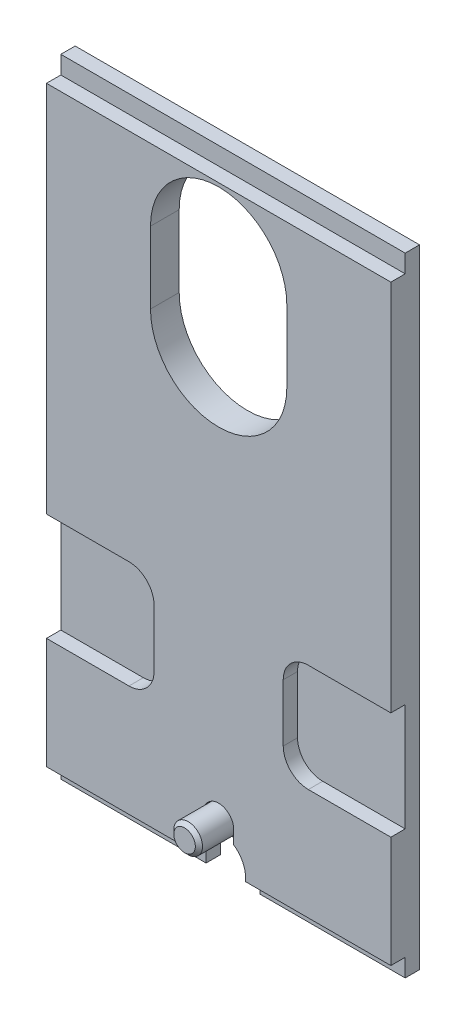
ISO-10303-21;
HEADER;
FILE_DESCRIPTION(('STEP AP214'),'2;1');
FILE_NAME('part.step','',(''),(''),'','','');
FILE_SCHEMA(('AUTOMOTIVE_DESIGN { 1 0 10303 214 1 1 1 1 }'));
ENDSEC;
DATA;
#1=APPLICATION_CONTEXT('core data for automotive mechanical design processes');
#2=APPLICATION_PROTOCOL_DEFINITION('international standard','automotive_design',2000,#1);
#3=PRODUCT_CONTEXT('',#1,'mechanical');
#4=PRODUCT('Part','Part','',(#3));
#5=PRODUCT_RELATED_PRODUCT_CATEGORY('part','',(#4));
#6=PRODUCT_DEFINITION_FORMATION('','',#4);
#7=PRODUCT_DEFINITION_CONTEXT('part definition',#1,'design');
#8=PRODUCT_DEFINITION('design','',#6,#7);
#9=PRODUCT_DEFINITION_SHAPE('','',#8);
#10=(LENGTH_UNIT() NAMED_UNIT(*) SI_UNIT(.MILLI.,.METRE.));
#11=(NAMED_UNIT(*) PLANE_ANGLE_UNIT() SI_UNIT($,.RADIAN.));
#12=(NAMED_UNIT(*) SI_UNIT($,.STERADIAN.) SOLID_ANGLE_UNIT());
#13=UNCERTAINTY_MEASURE_WITH_UNIT(LENGTH_MEASURE(1.E-05),#10,'distance_accuracy_value','');
#14=(GEOMETRIC_REPRESENTATION_CONTEXT(3) GLOBAL_UNCERTAINTY_ASSIGNED_CONTEXT((#13)) GLOBAL_UNIT_ASSIGNED_CONTEXT((#10,
#11,#12)) REPRESENTATION_CONTEXT('',''));
#15=CARTESIAN_POINT('',(0.,0.,0.));
#16=DIRECTION('',(0.,0.,1.));
#17=DIRECTION('',(1.,0.,0.));
#18=AXIS2_PLACEMENT_3D('',#15,#16,#17);
#19=CARTESIAN_POINT('',(0.,-70.4931459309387,-4.5));
#20=DIRECTION('',(0.,0.,-1.));
#21=DIRECTION('',(-1.,0.,0.));
#22=AXIS2_PLACEMENT_3D('',#19,#20,#21);
#23=PLANE('',#22);
#24=CARTESIAN_POINT('',(0.,-76.9931459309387,-4.5));
#25=DIRECTION('',(0.,0.,1.));
#26=DIRECTION('',(1.,0.,0.));
#27=AXIS2_PLACEMENT_3D('',#24,#25,#26);
#28=CIRCLE('',#27,4.);
#29=CARTESIAN_POINT('',(4.00000000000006,-76.9931459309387,-4.5));
#30=VERTEX_POINT('',#29);
#31=EDGE_CURVE('E432',#30,#30,#28,.T.);
#32=ORIENTED_EDGE('',*,*,#31,.F.);
#33=EDGE_LOOP('',(#32));
#34=FACE_BOUND('',#33,.T.);
#35=DIRECTION('',(0.,1.,0.));
#36=VECTOR('',#35,1.);
#37=CARTESIAN_POINT('',(-4.2,-70.4931459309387,-4.5));
#38=LINE('',#37,#36);
#39=CARTESIAN_POINT('',(-4.2,-80.7794513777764,-4.5));
#40=VERTEX_POINT('',#39);
#41=CARTESIAN_POINT('',(-4.2,-76.9931459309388,-4.5));
#42=VERTEX_POINT('',#41);
#43=EDGE_CURVE('E9',#40,#42,#38,.T.);
#44=ORIENTED_EDGE('',*,*,#43,.F.);
#45=CARTESIAN_POINT('',(0.,-86.9931459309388,-4.5));
#46=DIRECTION('',(0.,0.,-1.));
#47=DIRECTION('',(0.,1.,0.));
#48=AXIS2_PLACEMENT_3D('',#45,#46,#47);
#49=CIRCLE('',#48,7.5);
#50=CARTESIAN_POINT('',(-4.87442304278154,-81.2931459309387,-4.5));
#51=VERTEX_POINT('',#50);
#52=EDGE_CURVE('E24',#51,#40,#49,.T.);
#53=ORIENTED_EDGE('',*,*,#52,.F.);
#54=CARTESIAN_POINT('',(0.,-76.9931459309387,-4.5));
#55=DIRECTION('',(0.,0.,1.));
#56=DIRECTION('',(1.,0.,0.));
#57=AXIS2_PLACEMENT_3D('',#54,#55,#56);
#58=CIRCLE('',#57,6.5);
#59=CARTESIAN_POINT('',(4.8744230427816,-81.2931459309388,-4.5));
#60=VERTEX_POINT('',#59);
#61=EDGE_CURVE('E444',#51,#60,#58,.T.);
#62=ORIENTED_EDGE('',*,*,#61,.T.);
#63=CARTESIAN_POINT('',(0.,-86.9931459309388,-4.5));
#64=DIRECTION('',(0.,0.,-1.));
#65=DIRECTION('',(0.,1.,0.));
#66=AXIS2_PLACEMENT_3D('',#63,#64,#65);
#67=CIRCLE('',#66,7.5);
#68=CARTESIAN_POINT('',(4.2,-80.7794513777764,-4.5));
#69=VERTEX_POINT('',#68);
#70=EDGE_CURVE('E303',#69,#60,#67,.T.);
#71=ORIENTED_EDGE('',*,*,#70,.F.);
#72=DIRECTION('',(0.,-1.,0.));
#73=VECTOR('',#72,1.);
#74=CARTESIAN_POINT('',(4.2,-70.4931459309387,-4.5));
#75=LINE('',#74,#73);
#76=CARTESIAN_POINT('',(4.2,-76.9931459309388,-4.5));
#77=VERTEX_POINT('',#76);
#78=EDGE_CURVE('E298',#77,#69,#75,.T.);
#79=ORIENTED_EDGE('',*,*,#78,.F.);
#80=CARTESIAN_POINT('',(0.,-76.9931459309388,-4.5));
#81=DIRECTION('',(0.,0.,-1.));
#82=DIRECTION('',(-1.,0.,0.));
#83=AXIS2_PLACEMENT_3D('',#80,#81,#82);
#84=CIRCLE('',#83,4.2);
#85=EDGE_CURVE('E300',#42,#77,#84,.T.);
#86=ORIENTED_EDGE('',*,*,#85,.F.);
#87=EDGE_LOOP('',(#44,#53,#62,#71,#79,#86));
#88=FACE_BOUND('',#87,.T.);
#89=ADVANCED_FACE('F14',(#34,#88),#23,.F.);
#90=CARTESIAN_POINT('',(0.,-76.9931459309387,-9.5));
#91=DIRECTION('',(0.,0.,1.));
#92=DIRECTION('',(1.,0.,0.));
#93=AXIS2_PLACEMENT_3D('',#90,#91,#92);
#94=PLANE('',#93);
#95=DIRECTION('',(-0.5,-0.86602540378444,0.));
#96=VECTOR('',#95,1.);
#97=CARTESIAN_POINT('',(1.73205080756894,-79.9931459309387,-9.5));
#98=LINE('',#97,#96);
#99=CARTESIAN_POINT('',(3.46410161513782,-76.9931459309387,-9.5));
#100=VERTEX_POINT('',#99);
#101=CARTESIAN_POINT('',(1.73205080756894,-79.9931459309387,-9.5));
#102=VERTEX_POINT('',#101);
#103=EDGE_CURVE('E393',#100,#102,#98,.T.);
#104=ORIENTED_EDGE('',*,*,#103,.F.);
#105=DIRECTION('',(0.5,-0.866025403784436,0.));
#106=VECTOR('',#105,1.);
#107=CARTESIAN_POINT('',(3.46410161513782,-76.9931459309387,-9.5));
#108=LINE('',#107,#106);
#109=CARTESIAN_POINT('',(1.73205080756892,-73.9931459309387,-9.5));
#110=VERTEX_POINT('',#109);
#111=EDGE_CURVE('E390',#110,#100,#108,.T.);
#112=ORIENTED_EDGE('',*,*,#111,.F.);
#113=DIRECTION('',(1.,0.,0.));
#114=VECTOR('',#113,1.);
#115=CARTESIAN_POINT('',(1.73205080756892,-73.9931459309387,-9.5));
#116=LINE('',#115,#114);
#117=CARTESIAN_POINT('',(-1.73205080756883,-73.9931459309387,-9.5));
#118=VERTEX_POINT('',#117);
#119=EDGE_CURVE('E408',#118,#110,#116,.T.);
#120=ORIENTED_EDGE('',*,*,#119,.F.);
#121=DIRECTION('',(0.5,0.86602540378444,0.));
#122=VECTOR('',#121,1.);
#123=CARTESIAN_POINT('',(-1.73205080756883,-73.9931459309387,-9.5));
#124=LINE('',#123,#122);
#125=CARTESIAN_POINT('',(-3.4641016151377,-76.9931459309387,-9.5));
#126=VERTEX_POINT('',#125);
#127=EDGE_CURVE('E405',#126,#118,#124,.T.);
#128=ORIENTED_EDGE('',*,*,#127,.F.);
#129=DIRECTION('',(-0.5,0.866025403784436,0.));
#130=VECTOR('',#129,1.);
#131=CARTESIAN_POINT('',(-3.4641016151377,-76.9931459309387,-9.5));
#132=LINE('',#131,#130);
#133=CARTESIAN_POINT('',(-1.73205080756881,-79.9931459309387,-9.5));
#134=VERTEX_POINT('',#133);
#135=EDGE_CURVE('E402',#134,#126,#132,.T.);
#136=ORIENTED_EDGE('',*,*,#135,.F.);
#137=DIRECTION('',(-1.,0.,0.));
#138=VECTOR('',#137,1.);
#139=CARTESIAN_POINT('',(-1.73205080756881,-79.9931459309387,-9.5));
#140=LINE('',#139,#138);
#141=EDGE_CURVE('E398',#102,#134,#140,.T.);
#142=ORIENTED_EDGE('',*,*,#141,.F.);
#143=EDGE_LOOP('',(#104,#112,#120,#128,#136,#142));
#144=FACE_BOUND('',#143,.T.);
#145=CARTESIAN_POINT('',(0.,-76.9931459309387,-9.5));
#146=DIRECTION('',(0.,0.,1.));
#147=DIRECTION('',(1.,0.,0.));
#148=AXIS2_PLACEMENT_3D('',#145,#146,#147);
#149=CIRCLE('',#148,5.5);
#150=CARTESIAN_POINT('',(5.50000000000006,-76.9931459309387,-9.5));
#151=VERTEX_POINT('',#150);
#152=EDGE_CURVE('E449',#151,#151,#149,.F.);
#153=ORIENTED_EDGE('',*,*,#152,.T.);
#154=EDGE_LOOP('',(#153));
#155=FACE_BOUND('',#154,.T.);
#156=ADVANCED_FACE('F1152',(#144,#155),#94,.F.);
#157=CARTESIAN_POINT('',(0.,-76.9931459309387,9.5));
#158=DIRECTION('',(0.,0.,1.));
#159=DIRECTION('',(1.,0.,0.));
#160=AXIS2_PLACEMENT_3D('',#157,#158,#159);
#161=CYLINDRICAL_SURFACE('',#160,6.5);
#162=CARTESIAN_POINT('',(0.,-76.9931459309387,-8.5));
#163=DIRECTION('',(0.,0.,1.));
#164=DIRECTION('',(1.,0.,0.));
#165=AXIS2_PLACEMENT_3D('',#162,#163,#164);
#166=CIRCLE('',#165,6.5);
#167=CARTESIAN_POINT('',(6.50000000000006,-76.9931459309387,-8.5));
#168=VERTEX_POINT('',#167);
#169=EDGE_CURVE('E446',#168,#168,#166,.T.);
#170=ORIENTED_EDGE('',*,*,#169,.T.);
#171=EDGE_LOOP('',(#170));
#172=FACE_BOUND('',#171,.T.);
#173=ORIENTED_EDGE('',*,*,#61,.F.);
#174=EDGE_CURVE('E443',#60,#51,#58,.T.);
#175=ORIENTED_EDGE('',*,*,#174,.F.);
#176=EDGE_LOOP('',(#173,#175));
#177=FACE_BOUND('',#176,.T.);
#178=ADVANCED_FACE('F1142',(#172,#177),#161,.T.);
#179=CARTESIAN_POINT('',(0.,-76.9931459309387,9.5));
#180=DIRECTION('',(0.,0.,1.));
#181=DIRECTION('',(1.,0.,0.));
#182=AXIS2_PLACEMENT_3D('',#179,#180,#181);
#183=CYLINDRICAL_SURFACE('',#182,4.);
#184=CARTESIAN_POINT('',(0.,-76.9931459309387,8.5));
#185=DIRECTION('',(0.,0.,-1.));
#186=DIRECTION('',(-1.,0.,0.));
#187=AXIS2_PLACEMENT_3D('',#184,#185,#186);
#188=CIRCLE('',#187,4.);
#189=CARTESIAN_POINT('',(-3.99999999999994,-76.9931459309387,8.5));
#190=VERTEX_POINT('',#189);
#191=EDGE_CURVE('E455',#190,#190,#188,.T.);
#192=ORIENTED_EDGE('',*,*,#191,.T.);
#193=EDGE_LOOP('',(#192));
#194=FACE_BOUND('',#193,.T.);
#195=ORIENTED_EDGE('',*,*,#31,.T.);
#196=EDGE_LOOP('',(#195));
#197=FACE_BOUND('',#196,.T.);
#198=ADVANCED_FACE('F1132',(#194,#197),#183,.T.);
#199=CARTESIAN_POINT('',(0.,-72.9931459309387,9.5));
#200=DIRECTION('',(0.,0.,-1.));
#201=DIRECTION('',(-1.,0.,0.));
#202=AXIS2_PLACEMENT_3D('',#199,#200,#201);
#203=PLANE('',#202);
#204=CARTESIAN_POINT('',(0.,-76.9931459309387,9.5));
#205=DIRECTION('',(0.,0.,-1.));
#206=DIRECTION('',(-1.,0.,0.));
#207=AXIS2_PLACEMENT_3D('',#204,#205,#206);
#208=CIRCLE('',#207,3.);
#209=CARTESIAN_POINT('',(-2.99999999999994,-76.9931459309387,9.5));
#210=VERTEX_POINT('',#209);
#211=EDGE_CURVE('E452',#210,#210,#208,.F.);
#212=ORIENTED_EDGE('',*,*,#211,.T.);
#213=EDGE_LOOP('',(#212));
#214=FACE_BOUND('',#213,.T.);
#215=ADVANCED_FACE('F1122',(#214),#203,.F.);
#216=CARTESIAN_POINT('',(0.,-76.9931459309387,-8.5));
#217=DIRECTION('',(0.,0.,1.));
#218=DIRECTION('',(1.,0.,0.));
#219=AXIS2_PLACEMENT_3D('',#216,#217,#218);
#220=TOROIDAL_SURFACE('',#219,5.5,1.);
#221=ORIENTED_EDGE('',*,*,#152,.F.);
#222=EDGE_LOOP('',(#221));
#223=FACE_BOUND('',#222,.T.);
#224=ORIENTED_EDGE('',*,*,#169,.F.);
#225=EDGE_LOOP('',(#224));
#226=FACE_BOUND('',#225,.T.);
#227=ADVANCED_FACE('F1112',(#223,#226),#220,.T.);
#228=CARTESIAN_POINT('',(0.,-76.9931459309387,9.5));
#229=DIRECTION('',(0.,0.,-1.));
#230=DIRECTION('',(-1.,0.,0.));
#231=AXIS2_PLACEMENT_3D('',#228,#229,#230);
#232=CONICAL_SURFACE('',#231,3.,0.785398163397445);
#233=ORIENTED_EDGE('',*,*,#191,.F.);
#234=EDGE_LOOP('',(#233));
#235=FACE_BOUND('',#234,.T.);
#236=ORIENTED_EDGE('',*,*,#211,.F.);
#237=EDGE_LOOP('',(#236));
#238=FACE_BOUND('',#237,.T.);
#239=ADVANCED_FACE('F1103',(#235,#238),#232,.T.);
#240=CARTESIAN_POINT('',(3.46410161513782,-76.9931459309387,-6.5));
#241=DIRECTION('',(0.866025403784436,0.5,0.));
#242=DIRECTION('',(0.5,-0.866025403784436,0.));
#243=AXIS2_PLACEMENT_3D('',#240,#241,#242);
#244=PLANE('',#243);
#245=ORIENTED_EDGE('',*,*,#111,.T.);
#246=DIRECTION('',(0.,0.,-1.));
#247=VECTOR('',#246,1.);
#248=CARTESIAN_POINT('',(3.46410161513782,-76.9931459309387,-6.5));
#249=LINE('',#248,#247);
#250=CARTESIAN_POINT('',(3.46410161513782,-76.9931459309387,-6.5));
#251=VERTEX_POINT('',#250);
#252=EDGE_CURVE('E429',#251,#100,#249,.T.);
#253=ORIENTED_EDGE('',*,*,#252,.F.);
#254=DIRECTION('',(0.5,-0.866025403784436,0.));
#255=VECTOR('',#254,1.);
#256=CARTESIAN_POINT('',(3.46410161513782,-76.9931459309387,-6.5));
#257=LINE('',#256,#255);
#258=CARTESIAN_POINT('',(1.73205080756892,-73.9931459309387,-6.5));
#259=VERTEX_POINT('',#258);
#260=EDGE_CURVE('E411',#259,#251,#257,.T.);
#261=ORIENTED_EDGE('',*,*,#260,.F.);
#262=DIRECTION('',(0.,0.,-1.));
#263=VECTOR('',#262,1.);
#264=CARTESIAN_POINT('',(1.73205080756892,-73.9931459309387,-6.5));
#265=LINE('',#264,#263);
#266=EDGE_CURVE('E430',#259,#110,#265,.T.);
#267=ORIENTED_EDGE('',*,*,#266,.T.);
#268=EDGE_LOOP('',(#245,#253,#261,#267));
#269=FACE_BOUND('',#268,.T.);
#270=ADVANCED_FACE('F1093',(#269),#244,.F.);
#271=CARTESIAN_POINT('',(1.73205080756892,-73.9931459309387,-6.5));
#272=DIRECTION('',(0.,1.,0.));
#273=DIRECTION('',(1.,0.,0.));
#274=AXIS2_PLACEMENT_3D('',#271,#272,#273);
#275=PLANE('',#274);
#276=ORIENTED_EDGE('',*,*,#119,.T.);
#277=ORIENTED_EDGE('',*,*,#266,.F.);
#278=DIRECTION('',(1.,0.,0.));
#279=VECTOR('',#278,1.);
#280=CARTESIAN_POINT('',(1.73205080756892,-73.9931459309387,-6.5));
#281=LINE('',#280,#279);
#282=CARTESIAN_POINT('',(-1.73205080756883,-73.9931459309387,-6.5));
#283=VERTEX_POINT('',#282);
#284=EDGE_CURVE('E426',#283,#259,#281,.T.);
#285=ORIENTED_EDGE('',*,*,#284,.F.);
#286=DIRECTION('',(0.,0.,-1.));
#287=VECTOR('',#286,1.);
#288=CARTESIAN_POINT('',(-1.73205080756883,-73.9931459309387,-6.5));
#289=LINE('',#288,#287);
#290=EDGE_CURVE('E433',#283,#118,#289,.T.);
#291=ORIENTED_EDGE('',*,*,#290,.T.);
#292=EDGE_LOOP('',(#276,#277,#285,#291));
#293=FACE_BOUND('',#292,.T.);
#294=ADVANCED_FACE('F1083',(#293),#275,.F.);
#295=CARTESIAN_POINT('',(-1.73205080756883,-73.9931459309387,-6.5));
#296=DIRECTION('',(-0.86602540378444,0.5,0.));
#297=DIRECTION('',(0.5,0.86602540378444,0.));
#298=AXIS2_PLACEMENT_3D('',#295,#296,#297);
#299=PLANE('',#298);
#300=ORIENTED_EDGE('',*,*,#127,.T.);
#301=ORIENTED_EDGE('',*,*,#290,.F.);
#302=DIRECTION('',(0.5,0.86602540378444,0.));
#303=VECTOR('',#302,1.);
#304=CARTESIAN_POINT('',(-1.73205080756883,-73.9931459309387,-6.5));
#305=LINE('',#304,#303);
#306=CARTESIAN_POINT('',(-3.4641016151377,-76.9931459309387,-6.5));
#307=VERTEX_POINT('',#306);
#308=EDGE_CURVE('E423',#307,#283,#305,.T.);
#309=ORIENTED_EDGE('',*,*,#308,.F.);
#310=DIRECTION('',(0.,0.,-1.));
#311=VECTOR('',#310,1.);
#312=CARTESIAN_POINT('',(-3.4641016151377,-76.9931459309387,-6.5));
#313=LINE('',#312,#311);
#314=EDGE_CURVE('E435',#307,#126,#313,.T.);
#315=ORIENTED_EDGE('',*,*,#314,.T.);
#316=EDGE_LOOP('',(#300,#301,#309,#315));
#317=FACE_BOUND('',#316,.T.);
#318=ADVANCED_FACE('F1073',(#317),#299,.F.);
#319=CARTESIAN_POINT('',(-3.4641016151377,-76.9931459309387,-6.5));
#320=DIRECTION('',(-0.866025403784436,-0.5,0.));
#321=DIRECTION('',(-0.5,0.866025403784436,0.));
#322=AXIS2_PLACEMENT_3D('',#319,#320,#321);
#323=PLANE('',#322);
#324=ORIENTED_EDGE('',*,*,#135,.T.);
#325=ORIENTED_EDGE('',*,*,#314,.F.);
#326=DIRECTION('',(-0.5,0.866025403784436,0.));
#327=VECTOR('',#326,1.);
#328=CARTESIAN_POINT('',(-3.4641016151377,-76.9931459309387,-6.5));
#329=LINE('',#328,#327);
#330=CARTESIAN_POINT('',(-1.73205080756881,-79.9931459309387,-6.5));
#331=VERTEX_POINT('',#330);
#332=EDGE_CURVE('E420',#331,#307,#329,.T.);
#333=ORIENTED_EDGE('',*,*,#332,.F.);
#334=DIRECTION('',(0.,0.,-1.));
#335=VECTOR('',#334,1.);
#336=CARTESIAN_POINT('',(-1.73205080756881,-79.9931459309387,-6.5));
#337=LINE('',#336,#335);
#338=EDGE_CURVE('E437',#331,#134,#337,.T.);
#339=ORIENTED_EDGE('',*,*,#338,.T.);
#340=EDGE_LOOP('',(#324,#325,#333,#339));
#341=FACE_BOUND('',#340,.T.);
#342=ADVANCED_FACE('F1064',(#341),#323,.F.);
#343=CARTESIAN_POINT('',(-1.73205080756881,-79.9931459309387,-6.5));
#344=DIRECTION('',(0.,-1.,0.));
#345=DIRECTION('',(-1.,0.,0.));
#346=AXIS2_PLACEMENT_3D('',#343,#344,#345);
#347=PLANE('',#346);
#348=ORIENTED_EDGE('',*,*,#141,.T.);
#349=ORIENTED_EDGE('',*,*,#338,.F.);
#350=DIRECTION('',(-1.,0.,0.));
#351=VECTOR('',#350,1.);
#352=CARTESIAN_POINT('',(-1.73205080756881,-79.9931459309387,-6.5));
#353=LINE('',#352,#351);
#354=CARTESIAN_POINT('',(1.73205080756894,-79.9931459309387,-6.5));
#355=VERTEX_POINT('',#354);
#356=EDGE_CURVE('E417',#355,#331,#353,.T.);
#357=ORIENTED_EDGE('',*,*,#356,.F.);
#358=DIRECTION('',(0.,0.,-1.));
#359=VECTOR('',#358,1.);
#360=CARTESIAN_POINT('',(1.73205080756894,-79.9931459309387,-6.5));
#361=LINE('',#360,#359);
#362=EDGE_CURVE('E254',#355,#102,#361,.T.);
#363=ORIENTED_EDGE('',*,*,#362,.T.);
#364=EDGE_LOOP('',(#348,#349,#357,#363));
#365=FACE_BOUND('',#364,.T.);
#366=ADVANCED_FACE('F1054',(#365),#347,.F.);
#367=CARTESIAN_POINT('',(1.73205080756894,-79.9931459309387,-6.5));
#368=DIRECTION('',(0.86602540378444,-0.5,0.));
#369=DIRECTION('',(-0.5,-0.86602540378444,0.));
#370=AXIS2_PLACEMENT_3D('',#367,#368,#369);
#371=PLANE('',#370);
#372=ORIENTED_EDGE('',*,*,#103,.T.);
#373=ORIENTED_EDGE('',*,*,#362,.F.);
#374=DIRECTION('',(-0.5,-0.86602540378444,0.));
#375=VECTOR('',#374,1.);
#376=CARTESIAN_POINT('',(1.73205080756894,-79.9931459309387,-6.5));
#377=LINE('',#376,#375);
#378=EDGE_CURVE('E414',#251,#355,#377,.T.);
#379=ORIENTED_EDGE('',*,*,#378,.F.);
#380=ORIENTED_EDGE('',*,*,#252,.T.);
#381=EDGE_LOOP('',(#372,#373,#379,#380));
#382=FACE_BOUND('',#381,.T.);
#383=ADVANCED_FACE('F1044',(#382),#371,.F.);
#384=CARTESIAN_POINT('',(3.46410161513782,-76.9931459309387,-6.5));
#385=DIRECTION('',(0.,0.,-1.));
#386=DIRECTION('',(-1.,0.,0.));
#387=AXIS2_PLACEMENT_3D('',#384,#385,#386);
#388=PLANE('',#387);
#389=ORIENTED_EDGE('',*,*,#260,.T.);
#390=ORIENTED_EDGE('',*,*,#378,.T.);
#391=ORIENTED_EDGE('',*,*,#356,.T.);
#392=ORIENTED_EDGE('',*,*,#332,.T.);
#393=ORIENTED_EDGE('',*,*,#308,.T.);
#394=ORIENTED_EDGE('',*,*,#284,.T.);
#395=EDGE_LOOP('',(#389,#390,#391,#392,#393,#394));
#396=FACE_BOUND('',#395,.T.);
#397=ADVANCED_FACE('F1035',(#396),#388,.T.);
#398=CARTESIAN_POINT('',(25.,-49.9931459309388,-4.));
#399=DIRECTION('',(0.,0.,-1.));
#400=DIRECTION('',(-1.,0.,0.));
#401=AXIS2_PLACEMENT_3D('',#398,#399,#400);
#402=PLANE('',#401);
#403=DIRECTION('',(0.,1.,0.));
#404=VECTOR('',#403,1.);
#405=CARTESIAN_POINT('',(48.,-26.9931459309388,-4.));
#406=LINE('',#405,#404);
#407=CARTESIAN_POINT('',(48.,-56.9931459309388,-4.));
#408=VERTEX_POINT('',#407);
#409=CARTESIAN_POINT('',(48.,-26.9931459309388,-4.));
#410=VERTEX_POINT('',#409);
#411=EDGE_CURVE('E515',#408,#410,#406,.T.);
#412=ORIENTED_EDGE('',*,*,#411,.T.);
#413=DIRECTION('',(-1.,0.,0.));
#414=VECTOR('',#413,1.);
#415=CARTESIAN_POINT('',(25.,-26.9931459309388,-4.));
#416=LINE('',#415,#414);
#417=CARTESIAN_POINT('',(25.,-26.9931459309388,-4.));
#418=VERTEX_POINT('',#417);
#419=EDGE_CURVE('E518',#410,#418,#416,.T.);
#420=ORIENTED_EDGE('',*,*,#419,.T.);
#421=CARTESIAN_POINT('',(25.,-33.9931459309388,-4.));
#422=DIRECTION('',(0.,0.,1.));
#423=DIRECTION('',(-1.,0.,0.));
#424=AXIS2_PLACEMENT_3D('',#421,#422,#423);
#425=CIRCLE('',#424,7.);
#426=CARTESIAN_POINT('',(18.,-33.9931459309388,-4.));
#427=VERTEX_POINT('',#426);
#428=EDGE_CURVE('E521',#418,#427,#425,.T.);
#429=ORIENTED_EDGE('',*,*,#428,.T.);
#430=DIRECTION('',(0.,-1.,0.));
#431=VECTOR('',#430,1.);
#432=CARTESIAN_POINT('',(18.,-49.9931459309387,-4.));
#433=LINE('',#432,#431);
#434=CARTESIAN_POINT('',(18.,-49.9931459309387,-4.));
#435=VERTEX_POINT('',#434);
#436=EDGE_CURVE('E524',#427,#435,#433,.T.);
#437=ORIENTED_EDGE('',*,*,#436,.T.);
#438=CARTESIAN_POINT('',(25.,-49.9931459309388,-4.));
#439=DIRECTION('',(0.,0.,1.));
#440=DIRECTION('',(-1.,0.,0.));
#441=AXIS2_PLACEMENT_3D('',#438,#439,#440);
#442=CIRCLE('',#441,7.);
#443=CARTESIAN_POINT('',(25.,-56.9931459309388,-4.));
#444=VERTEX_POINT('',#443);
#445=EDGE_CURVE('E527',#435,#444,#442,.T.);
#446=ORIENTED_EDGE('',*,*,#445,.T.);
#447=DIRECTION('',(1.,0.,0.));
#448=VECTOR('',#447,1.);
#449=CARTESIAN_POINT('',(48.,-56.9931459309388,-4.));
#450=LINE('',#449,#448);
#451=EDGE_CURVE('E530',#444,#408,#450,.T.);
#452=ORIENTED_EDGE('',*,*,#451,.T.);
#453=EDGE_LOOP('',(#412,#420,#429,#437,#446,#452));
#454=FACE_BOUND('',#453,.T.);
#455=ADVANCED_FACE('F785',(#454),#402,.F.);
#456=CARTESIAN_POINT('',(48.,82.0068540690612,-4.));
#457=DIRECTION('',(0.,0.,-1.));
#458=DIRECTION('',(0.,-1.,0.));
#459=AXIS2_PLACEMENT_3D('',#456,#457,#458);
#460=PLANE('',#459);
#461=DIRECTION('',(0.,-1.,0.));
#462=VECTOR('',#461,1.);
#463=CARTESIAN_POINT('',(-48.,82.0068540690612,-4.));
#464=LINE('',#463,#462);
#465=CARTESIAN_POINT('',(-48.,82.0068540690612,-4.));
#466=VERTEX_POINT('',#465);
#467=CARTESIAN_POINT('',(-48.,77.0068540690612,-4.));
#468=VERTEX_POINT('',#467);
#469=EDGE_CURVE('E573',#466,#468,#464,.T.);
#470=ORIENTED_EDGE('',*,*,#469,.T.);
#471=DIRECTION('',(-1.,0.,0.));
#472=VECTOR('',#471,1.);
#473=CARTESIAN_POINT('',(48.,77.0068540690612,-4.));
#474=LINE('',#473,#472);
#475=CARTESIAN_POINT('',(48.,77.0068540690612,-4.));
#476=VERTEX_POINT('',#475);
#477=EDGE_CURVE('E584',#476,#468,#474,.T.);
#478=ORIENTED_EDGE('',*,*,#477,.F.);
#479=DIRECTION('',(0.,-1.,0.));
#480=VECTOR('',#479,1.);
#481=CARTESIAN_POINT('',(48.,82.0068540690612,-4.));
#482=LINE('',#481,#480);
#483=CARTESIAN_POINT('',(48.,82.0068540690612,-4.));
#484=VERTEX_POINT('',#483);
#485=EDGE_CURVE('E578',#484,#476,#482,.T.);
#486=ORIENTED_EDGE('',*,*,#485,.F.);
#487=DIRECTION('',(-1.,0.,0.));
#488=VECTOR('',#487,1.);
#489=CARTESIAN_POINT('',(48.,82.0068540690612,-4.));
#490=LINE('',#489,#488);
#491=EDGE_CURVE('E585',#484,#466,#490,.T.);
#492=ORIENTED_EDGE('',*,*,#491,.T.);
#493=EDGE_LOOP('',(#470,#478,#486,#492));
#494=FACE_BOUND('',#493,.T.);
#495=ADVANCED_FACE('F782',(#494),#460,.F.);
#496=CARTESIAN_POINT('',(-25.,-49.9931459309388,-4.));
#497=DIRECTION('',(0.,0.,1.));
#498=DIRECTION('',(1.,0.,0.));
#499=AXIS2_PLACEMENT_3D('',#496,#497,#498);
#500=PLANE('',#499);
#501=CARTESIAN_POINT('',(-25.,-49.9931459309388,-4.));
#502=DIRECTION('',(0.,0.,1.));
#503=DIRECTION('',(1.,0.,0.));
#504=AXIS2_PLACEMENT_3D('',#501,#502,#503);
#505=CIRCLE('',#504,7.);
#506=CARTESIAN_POINT('',(-25.,-56.9931459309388,-4.));
#507=VERTEX_POINT('',#506);
#508=CARTESIAN_POINT('',(-18.,-49.9931459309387,-4.));
#509=VERTEX_POINT('',#508);
#510=EDGE_CURVE('E472',#507,#509,#505,.T.);
#511=ORIENTED_EDGE('',*,*,#510,.T.);
#512=DIRECTION('',(0.,1.,0.));
#513=VECTOR('',#512,1.);
#514=CARTESIAN_POINT('',(-18.,-49.9931459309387,-4.));
#515=LINE('',#514,#513);
#516=CARTESIAN_POINT('',(-18.,-33.9931459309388,-4.));
#517=VERTEX_POINT('',#516);
#518=EDGE_CURVE('E475',#509,#517,#515,.T.);
#519=ORIENTED_EDGE('',*,*,#518,.T.);
#520=CARTESIAN_POINT('',(-25.,-33.9931459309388,-4.));
#521=DIRECTION('',(0.,0.,1.));
#522=DIRECTION('',(1.,0.,0.));
#523=AXIS2_PLACEMENT_3D('',#520,#521,#522);
#524=CIRCLE('',#523,7.);
#525=CARTESIAN_POINT('',(-25.,-26.9931459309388,-4.));
#526=VERTEX_POINT('',#525);
#527=EDGE_CURVE('E478',#517,#526,#524,.T.);
#528=ORIENTED_EDGE('',*,*,#527,.T.);
#529=DIRECTION('',(-1.,0.,0.));
#530=VECTOR('',#529,1.);
#531=CARTESIAN_POINT('',(-25.,-26.9931459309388,-4.));
#532=LINE('',#531,#530);
#533=CARTESIAN_POINT('',(-48.,-26.9931459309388,-4.));
#534=VERTEX_POINT('',#533);
#535=EDGE_CURVE('E481',#526,#534,#532,.T.);
#536=ORIENTED_EDGE('',*,*,#535,.T.);
#537=DIRECTION('',(0.,-1.,0.));
#538=VECTOR('',#537,1.);
#539=CARTESIAN_POINT('',(-48.,-26.9931459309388,-4.));
#540=LINE('',#539,#538);
#541=CARTESIAN_POINT('',(-48.,-56.9931459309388,-4.));
#542=VERTEX_POINT('',#541);
#543=EDGE_CURVE('E484',#534,#542,#540,.T.);
#544=ORIENTED_EDGE('',*,*,#543,.T.);
#545=DIRECTION('',(1.,0.,0.));
#546=VECTOR('',#545,1.);
#547=CARTESIAN_POINT('',(-48.,-56.9931459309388,-4.));
#548=LINE('',#547,#546);
#549=EDGE_CURVE('E486',#542,#507,#548,.T.);
#550=ORIENTED_EDGE('',*,*,#549,.T.);
#551=EDGE_LOOP('',(#511,#519,#528,#536,#544,#550));
#552=FACE_BOUND('',#551,.T.);
#553=ADVANCED_FACE('F740',(#552),#500,.T.);
#554=CARTESIAN_POINT('',(-1.05703964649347E-13,82.0068540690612,-8.));
#555=DIRECTION('',(0.,1.,0.));
#556=DIRECTION('',(1.,0.,0.));
#557=AXIS2_PLACEMENT_3D('',#554,#555,#556);
#558=PLANE('',#557);
#559=ORIENTED_EDGE('',*,*,#491,.F.);
#560=DIRECTION('',(0.,0.,1.));
#561=VECTOR('',#560,1.);
#562=CARTESIAN_POINT('',(48.,82.0068540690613,-8.));
#563=LINE('',#562,#561);
#564=CARTESIAN_POINT('',(48.,82.0068540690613,-8.));
#565=VERTEX_POINT('',#564);
#566=EDGE_CURVE('E380',#565,#484,#563,.T.);
#567=ORIENTED_EDGE('',*,*,#566,.F.);
#568=DIRECTION('',(-1.,0.,0.));
#569=VECTOR('',#568,1.);
#570=CARTESIAN_POINT('',(-1.05703964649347E-13,82.0068540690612,-8.));
#571=LINE('',#570,#569);
#572=CARTESIAN_POINT('',(-48.,82.0068540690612,-8.));
#573=VERTEX_POINT('',#572);
#574=EDGE_CURVE('E359',#565,#573,#571,.T.);
#575=ORIENTED_EDGE('',*,*,#574,.T.);
#576=DIRECTION('',(0.,0.,1.));
#577=VECTOR('',#576,1.);
#578=CARTESIAN_POINT('',(-48.,82.0068540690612,-8.));
#579=LINE('',#578,#577);
#580=EDGE_CURVE('E371',#573,#466,#579,.T.);
#581=ORIENTED_EDGE('',*,*,#580,.T.);
#582=EDGE_LOOP('',(#559,#567,#575,#581));
#583=FACE_BOUND('',#582,.T.);
#584=ADVANCED_FACE('F16',(#583),#558,.T.);
#585=CARTESIAN_POINT('',(0.,-92.9931459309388,-8.));
#586=DIRECTION('',(0.,1.,0.));
#587=DIRECTION('',(0.,0.,-1.));
#588=AXIS2_PLACEMENT_3D('',#585,#586,#587);
#589=PLANE('',#588);
#590=DIRECTION('',(0.,0.,-1.));
#591=VECTOR('',#590,1.);
#592=CARTESIAN_POINT('',(-7.5,-92.9931459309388,-4.5));
#593=LINE('',#592,#591);
#594=CARTESIAN_POINT('',(-7.5,-92.9931459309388,-4.));
#595=VERTEX_POINT('',#594);
#596=CARTESIAN_POINT('',(-7.5,-92.9931459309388,-8.));
#597=VERTEX_POINT('',#596);
#598=EDGE_CURVE('E643',#595,#597,#593,.T.);
#599=ORIENTED_EDGE('',*,*,#598,.F.);
#600=DIRECTION('',(-1.,0.,0.));
#601=VECTOR('',#600,1.);
#602=CARTESIAN_POINT('',(48.,-92.9931459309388,-4.));
#603=LINE('',#602,#601);
#604=CARTESIAN_POINT('',(-48.,-92.9931459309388,-4.));
#605=VERTEX_POINT('',#604);
#606=EDGE_CURVE('E556',#595,#605,#603,.T.);
#607=ORIENTED_EDGE('',*,*,#606,.T.);
#608=DIRECTION('',(0.,0.,1.));
#609=VECTOR('',#608,1.);
#610=CARTESIAN_POINT('',(-48.,-92.9931459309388,-8.));
#611=LINE('',#610,#609);
#612=CARTESIAN_POINT('',(-48.,-92.9931459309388,-8.));
#613=VERTEX_POINT('',#612);
#614=EDGE_CURVE('E374',#613,#605,#611,.T.);
#615=ORIENTED_EDGE('',*,*,#614,.F.);
#616=DIRECTION('',(-1.,0.,0.));
#617=VECTOR('',#616,1.);
#618=CARTESIAN_POINT('',(0.,-92.9931459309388,-8.));
#619=LINE('',#618,#617);
#620=EDGE_CURVE('E364',#597,#613,#619,.T.);
#621=ORIENTED_EDGE('',*,*,#620,.F.);
#622=EDGE_LOOP('',(#599,#607,#615,#621));
#623=FACE_BOUND('',#622,.T.);
#624=ADVANCED_FACE('F720',(#623),#589,.F.);
#625=CARTESIAN_POINT('',(48.,-92.9931459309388,-4.));
#626=DIRECTION('',(0.,0.,-1.));
#627=DIRECTION('',(-1.,0.,0.));
#628=AXIS2_PLACEMENT_3D('',#625,#626,#627);
#629=PLANE('',#628);
#630=DIRECTION('',(-1.,0.,0.));
#631=VECTOR('',#630,1.);
#632=CARTESIAN_POINT('',(48.,-87.9931459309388,-4.));
#633=LINE('',#632,#631);
#634=CARTESIAN_POINT('',(-7.5,-87.9931459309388,-4.));
#635=VERTEX_POINT('',#634);
#636=CARTESIAN_POINT('',(-48.,-87.9931459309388,-4.));
#637=VERTEX_POINT('',#636);
#638=EDGE_CURVE('E561',#635,#637,#633,.T.);
#639=ORIENTED_EDGE('',*,*,#638,.T.);
#640=DIRECTION('',(0.,-1.,0.));
#641=VECTOR('',#640,1.);
#642=CARTESIAN_POINT('',(-48.,-92.9931459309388,-4.));
#643=LINE('',#642,#641);
#644=EDGE_CURVE('E536',#637,#605,#643,.T.);
#645=ORIENTED_EDGE('',*,*,#644,.T.);
#646=ORIENTED_EDGE('',*,*,#606,.F.);
#647=DIRECTION('',(0.,-1.,0.));
#648=VECTOR('',#647,1.);
#649=CARTESIAN_POINT('',(-7.5,-76.9931459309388,-4.));
#650=LINE('',#649,#648);
#651=EDGE_CURVE('E18',#635,#595,#650,.T.);
#652=ORIENTED_EDGE('',*,*,#651,.F.);
#653=EDGE_LOOP('',(#639,#645,#646,#652));
#654=FACE_BOUND('',#653,.T.);
#655=ADVANCED_FACE('F727',(#654),#629,.F.);
#656=CARTESIAN_POINT('',(-18.,-49.9931459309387,-4.));
#657=DIRECTION('',(1.,0.,0.));
#658=DIRECTION('',(0.,0.,-1.));
#659=AXIS2_PLACEMENT_3D('',#656,#657,#658);
#660=PLANE('',#659);
#661=DIRECTION('',(0.,1.,0.));
#662=VECTOR('',#661,1.);
#663=CARTESIAN_POINT('',(-18.,-49.9931459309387,0.));
#664=LINE('',#663,#662);
#665=CARTESIAN_POINT('',(-18.,-49.9931459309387,0.));
#666=VERTEX_POINT('',#665);
#667=CARTESIAN_POINT('',(-18.,-33.9931459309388,0.));
#668=VERTEX_POINT('',#667);
#669=EDGE_CURVE('E461',#666,#668,#664,.T.);
#670=ORIENTED_EDGE('',*,*,#669,.T.);
#671=DIRECTION('',(0.,0.,1.));
#672=VECTOR('',#671,1.);
#673=CARTESIAN_POINT('',(-18.,-33.9931459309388,-4.));
#674=LINE('',#673,#672);
#675=EDGE_CURVE('E500',#517,#668,#674,.T.);
#676=ORIENTED_EDGE('',*,*,#675,.F.);
#677=ORIENTED_EDGE('',*,*,#518,.F.);
#678=DIRECTION('',(0.,0.,1.));
#679=VECTOR('',#678,1.);
#680=CARTESIAN_POINT('',(-18.,-49.9931459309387,-4.));
#681=LINE('',#680,#679);
#682=EDGE_CURVE('E489',#509,#666,#681,.T.);
#683=ORIENTED_EDGE('',*,*,#682,.T.);
#684=EDGE_LOOP('',(#670,#676,#677,#683));
#685=FACE_BOUND('',#684,.T.);
#686=ADVANCED_FACE('F737',(#685),#660,.F.);
#687=CARTESIAN_POINT('',(-25.,-33.9931459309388,-4.));
#688=DIRECTION('',(0.,0.,1.));
#689=DIRECTION('',(1.,0.,0.));
#690=AXIS2_PLACEMENT_3D('',#687,#688,#689);
#691=CYLINDRICAL_SURFACE('',#690,7.);
#692=CARTESIAN_POINT('',(-25.,-33.9931459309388,0.));
#693=DIRECTION('',(0.,0.,1.));
#694=DIRECTION('',(1.,0.,0.));
#695=AXIS2_PLACEMENT_3D('',#692,#693,#694);
#696=CIRCLE('',#695,7.);
#697=CARTESIAN_POINT('',(-25.,-26.9931459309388,0.));
#698=VERTEX_POINT('',#697);
#699=EDGE_CURVE('E464',#668,#698,#696,.T.);
#700=ORIENTED_EDGE('',*,*,#699,.T.);
#701=DIRECTION('',(0.,0.,1.));
#702=VECTOR('',#701,1.);
#703=CARTESIAN_POINT('',(-25.,-26.9931459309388,-4.));
#704=LINE('',#703,#702);
#705=EDGE_CURVE('E498',#526,#698,#704,.T.);
#706=ORIENTED_EDGE('',*,*,#705,.F.);
#707=ORIENTED_EDGE('',*,*,#527,.F.);
#708=ORIENTED_EDGE('',*,*,#675,.T.);
#709=EDGE_LOOP('',(#700,#706,#707,#708));
#710=FACE_BOUND('',#709,.T.);
#711=ADVANCED_FACE('F980',(#710),#691,.F.);
#712=CARTESIAN_POINT('',(-25.,-26.9931459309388,-4.));
#713=DIRECTION('',(0.,1.,0.));
#714=DIRECTION('',(1.,0.,0.));
#715=AXIS2_PLACEMENT_3D('',#712,#713,#714);
#716=PLANE('',#715);
#717=DIRECTION('',(-1.,0.,0.));
#718=VECTOR('',#717,1.);
#719=CARTESIAN_POINT('',(-25.,-26.9931459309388,0.));
#720=LINE('',#719,#718);
#721=CARTESIAN_POINT('',(-48.,-26.9931459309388,0.));
#722=VERTEX_POINT('',#721);
#723=EDGE_CURVE('E467',#698,#722,#720,.T.);
#724=ORIENTED_EDGE('',*,*,#723,.T.);
#725=DIRECTION('',(0.,0.,1.));
#726=VECTOR('',#725,1.);
#727=CARTESIAN_POINT('',(-48.,-26.9931459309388,-4.));
#728=LINE('',#727,#726);
#729=EDGE_CURVE('E495',#534,#722,#728,.T.);
#730=ORIENTED_EDGE('',*,*,#729,.F.);
#731=ORIENTED_EDGE('',*,*,#535,.F.);
#732=ORIENTED_EDGE('',*,*,#705,.T.);
#733=EDGE_LOOP('',(#724,#730,#731,#732));
#734=FACE_BOUND('',#733,.T.);
#735=ADVANCED_FACE('F780',(#734),#716,.F.);
#736=CARTESIAN_POINT('',(48.,77.0068540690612,-4.));
#737=DIRECTION('',(0.,-1.,0.));
#738=DIRECTION('',(0.,0.,1.));
#739=AXIS2_PLACEMENT_3D('',#736,#737,#738);
#740=PLANE('',#739);
#741=DIRECTION('',(0.,0.,1.));
#742=VECTOR('',#741,1.);
#743=CARTESIAN_POINT('',(-48.,77.0068540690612,-4.));
#744=LINE('',#743,#742);
#745=CARTESIAN_POINT('',(-48.,77.0068540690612,0.));
#746=VERTEX_POINT('',#745);
#747=EDGE_CURVE('E576',#468,#746,#744,.T.);
#748=ORIENTED_EDGE('',*,*,#747,.T.);
#749=DIRECTION('',(-1.,0.,0.));
#750=VECTOR('',#749,1.);
#751=CARTESIAN_POINT('',(48.,77.0068540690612,0.));
#752=LINE('',#751,#750);
#753=CARTESIAN_POINT('',(48.,77.0068540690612,0.));
#754=VERTEX_POINT('',#753);
#755=EDGE_CURVE('E588',#754,#746,#752,.T.);
#756=ORIENTED_EDGE('',*,*,#755,.F.);
#757=DIRECTION('',(0.,0.,1.));
#758=VECTOR('',#757,1.);
#759=CARTESIAN_POINT('',(48.,77.0068540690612,-4.));
#760=LINE('',#759,#758);
#761=EDGE_CURVE('E581',#476,#754,#760,.T.);
#762=ORIENTED_EDGE('',*,*,#761,.F.);
#763=ORIENTED_EDGE('',*,*,#477,.T.);
#764=EDGE_LOOP('',(#748,#756,#762,#763));
#765=FACE_BOUND('',#764,.T.);
#766=ADVANCED_FACE('F754',(#765),#740,.F.);
#767=CARTESIAN_POINT('',(25.,-26.9931459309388,-4.));
#768=DIRECTION('',(0.,1.,0.));
#769=DIRECTION('',(1.,0.,0.));
#770=AXIS2_PLACEMENT_3D('',#767,#768,#769);
#771=PLANE('',#770);
#772=DIRECTION('',(-1.,0.,0.));
#773=VECTOR('',#772,1.);
#774=CARTESIAN_POINT('',(25.,-26.9931459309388,0.));
#775=LINE('',#774,#773);
#776=CARTESIAN_POINT('',(48.,-26.9931459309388,0.));
#777=VERTEX_POINT('',#776);
#778=CARTESIAN_POINT('',(25.,-26.9931459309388,0.));
#779=VERTEX_POINT('',#778);
#780=EDGE_CURVE('E492',#777,#779,#775,.T.);
#781=ORIENTED_EDGE('',*,*,#780,.T.);
#782=DIRECTION('',(0.,0.,1.));
#783=VECTOR('',#782,1.);
#784=CARTESIAN_POINT('',(25.,-26.9931459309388,-4.));
#785=LINE('',#784,#783);
#786=EDGE_CURVE('E543',#418,#779,#785,.T.);
#787=ORIENTED_EDGE('',*,*,#786,.F.);
#788=ORIENTED_EDGE('',*,*,#419,.F.);
#789=DIRECTION('',(0.,0.,1.));
#790=VECTOR('',#789,1.);
#791=CARTESIAN_POINT('',(48.,-26.9931459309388,-4.));
#792=LINE('',#791,#790);
#793=EDGE_CURVE('E239',#410,#777,#792,.T.);
#794=ORIENTED_EDGE('',*,*,#793,.T.);
#795=EDGE_LOOP('',(#781,#787,#788,#794));
#796=FACE_BOUND('',#795,.T.);
#797=ADVANCED_FACE('F775',(#796),#771,.F.);
#798=CARTESIAN_POINT('',(25.,-33.9931459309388,-4.));
#799=DIRECTION('',(0.,0.,1.));
#800=DIRECTION('',(1.,0.,0.));
#801=AXIS2_PLACEMENT_3D('',#798,#799,#800);
#802=CYLINDRICAL_SURFACE('',#801,7.);
#803=CARTESIAN_POINT('',(25.,-33.9931459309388,0.));
#804=DIRECTION('',(0.,0.,1.));
#805=DIRECTION('',(-1.,0.,0.));
#806=AXIS2_PLACEMENT_3D('',#803,#804,#805);
#807=CIRCLE('',#806,7.);
#808=CARTESIAN_POINT('',(18.,-33.9931459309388,0.));
#809=VERTEX_POINT('',#808);
#810=EDGE_CURVE('E504',#779,#809,#807,.T.);
#811=ORIENTED_EDGE('',*,*,#810,.T.);
#812=DIRECTION('',(0.,0.,1.));
#813=VECTOR('',#812,1.);
#814=CARTESIAN_POINT('',(18.,-33.9931459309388,-4.));
#815=LINE('',#814,#813);
#816=EDGE_CURVE('E541',#427,#809,#815,.T.);
#817=ORIENTED_EDGE('',*,*,#816,.F.);
#818=ORIENTED_EDGE('',*,*,#428,.F.);
#819=ORIENTED_EDGE('',*,*,#786,.T.);
#820=EDGE_LOOP('',(#811,#817,#818,#819));
#821=FACE_BOUND('',#820,.T.);
#822=ADVANCED_FACE('F950',(#821),#802,.F.);
#823=CARTESIAN_POINT('',(18.,-49.9931459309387,-4.));
#824=DIRECTION('',(-1.,0.,0.));
#825=DIRECTION('',(0.,0.,1.));
#826=AXIS2_PLACEMENT_3D('',#823,#824,#825);
#827=PLANE('',#826);
#828=DIRECTION('',(0.,-1.,0.));
#829=VECTOR('',#828,1.);
#830=CARTESIAN_POINT('',(18.,-49.9931459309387,0.));
#831=LINE('',#830,#829);
#832=CARTESIAN_POINT('',(18.,-49.9931459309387,0.));
#833=VERTEX_POINT('',#832);
#834=EDGE_CURVE('E507',#809,#833,#831,.T.);
#835=ORIENTED_EDGE('',*,*,#834,.T.);
#836=DIRECTION('',(0.,0.,1.));
#837=VECTOR('',#836,1.);
#838=CARTESIAN_POINT('',(18.,-49.9931459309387,-4.));
#839=LINE('',#838,#837);
#840=EDGE_CURVE('E539',#435,#833,#839,.T.);
#841=ORIENTED_EDGE('',*,*,#840,.F.);
#842=ORIENTED_EDGE('',*,*,#436,.F.);
#843=ORIENTED_EDGE('',*,*,#816,.T.);
#844=EDGE_LOOP('',(#835,#841,#842,#843));
#845=FACE_BOUND('',#844,.T.);
#846=ADVANCED_FACE('F762',(#845),#827,.F.);
#847=CARTESIAN_POINT('',(25.,-49.9931459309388,-4.));
#848=DIRECTION('',(0.,0.,1.));
#849=DIRECTION('',(1.,0.,0.));
#850=AXIS2_PLACEMENT_3D('',#847,#848,#849);
#851=CYLINDRICAL_SURFACE('',#850,7.);
#852=CARTESIAN_POINT('',(25.,-49.9931459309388,0.));
#853=DIRECTION('',(0.,0.,1.));
#854=DIRECTION('',(-1.,0.,0.));
#855=AXIS2_PLACEMENT_3D('',#852,#853,#854);
#856=CIRCLE('',#855,7.);
#857=CARTESIAN_POINT('',(25.,-56.9931459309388,0.));
#858=VERTEX_POINT('',#857);
#859=EDGE_CURVE('E510',#833,#858,#856,.T.);
#860=ORIENTED_EDGE('',*,*,#859,.T.);
#861=DIRECTION('',(0.,0.,1.));
#862=VECTOR('',#861,1.);
#863=CARTESIAN_POINT('',(25.,-56.9931459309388,-4.));
#864=LINE('',#863,#862);
#865=EDGE_CURVE('E537',#444,#858,#864,.T.);
#866=ORIENTED_EDGE('',*,*,#865,.F.);
#867=ORIENTED_EDGE('',*,*,#445,.F.);
#868=ORIENTED_EDGE('',*,*,#840,.T.);
#869=EDGE_LOOP('',(#860,#866,#867,#868));
#870=FACE_BOUND('',#869,.T.);
#871=ADVANCED_FACE('F755',(#870),#851,.F.);
#872=CARTESIAN_POINT('',(48.,-56.9931459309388,-4.));
#873=DIRECTION('',(0.,-1.,0.));
#874=DIRECTION('',(0.,0.,1.));
#875=AXIS2_PLACEMENT_3D('',#872,#873,#874);
#876=PLANE('',#875);
#877=DIRECTION('',(1.,0.,0.));
#878=VECTOR('',#877,1.);
#879=CARTESIAN_POINT('',(48.,-56.9931459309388,0.));
#880=LINE('',#879,#878);
#881=CARTESIAN_POINT('',(48.,-56.9931459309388,0.));
#882=VERTEX_POINT('',#881);
#883=EDGE_CURVE('E513',#858,#882,#880,.T.);
#884=ORIENTED_EDGE('',*,*,#883,.T.);
#885=DIRECTION('',(0.,0.,1.));
#886=VECTOR('',#885,1.);
#887=CARTESIAN_POINT('',(48.,-56.9931459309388,-4.));
#888=LINE('',#887,#886);
#889=EDGE_CURVE('E533',#408,#882,#888,.T.);
#890=ORIENTED_EDGE('',*,*,#889,.F.);
#891=ORIENTED_EDGE('',*,*,#451,.F.);
#892=ORIENTED_EDGE('',*,*,#865,.T.);
#893=EDGE_LOOP('',(#884,#890,#891,#892));
#894=FACE_BOUND('',#893,.T.);
#895=ADVANCED_FACE('F746',(#894),#876,.F.);
#896=CARTESIAN_POINT('',(48.,-160.888568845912,-8.));
#897=DIRECTION('',(-1.,0.,0.));
#898=DIRECTION('',(0.,0.,1.));
#899=AXIS2_PLACEMENT_3D('',#896,#897,#898);
#900=PLANE('',#899);
#901=ORIENTED_EDGE('',*,*,#411,.F.);
#902=ORIENTED_EDGE('',*,*,#889,.T.);
#903=DIRECTION('',(0.,-1.,0.));
#904=VECTOR('',#903,1.);
#905=CARTESIAN_POINT('',(48.,-160.888568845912,0.));
#906=LINE('',#905,#904);
#907=CARTESIAN_POINT('',(48.,-87.9931459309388,0.));
#908=VERTEX_POINT('',#907);
#909=EDGE_CURVE('E351',#882,#908,#906,.T.);
#910=ORIENTED_EDGE('',*,*,#909,.T.);
#911=DIRECTION('',(0.,0.,-1.));
#912=VECTOR('',#911,1.);
#913=CARTESIAN_POINT('',(48.,-87.9931459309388,-4.));
#914=LINE('',#913,#912);
#915=CARTESIAN_POINT('',(48.,-87.9931459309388,-4.));
#916=VERTEX_POINT('',#915);
#917=EDGE_CURVE('E553',#908,#916,#914,.T.);
#918=ORIENTED_EDGE('',*,*,#917,.T.);
#919=DIRECTION('',(0.,-1.,0.));
#920=VECTOR('',#919,1.);
#921=CARTESIAN_POINT('',(48.,-92.9931459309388,-4.));
#922=LINE('',#921,#920);
#923=CARTESIAN_POINT('',(48.,-92.9931459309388,-4.));
#924=VERTEX_POINT('',#923);
#925=EDGE_CURVE('E550',#916,#924,#922,.T.);
#926=ORIENTED_EDGE('',*,*,#925,.T.);
#927=DIRECTION('',(0.,0.,1.));
#928=VECTOR('',#927,1.);
#929=CARTESIAN_POINT('',(48.,-92.9931459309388,-8.));
#930=LINE('',#929,#928);
#931=CARTESIAN_POINT('',(48.,-92.9931459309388,-8.));
#932=VERTEX_POINT('',#931);
#933=EDGE_CURVE('E377',#932,#924,#930,.T.);
#934=ORIENTED_EDGE('',*,*,#933,.F.);
#935=DIRECTION('',(0.,-1.,0.));
#936=VECTOR('',#935,1.);
#937=CARTESIAN_POINT('',(48.,-160.888568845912,-8.));
#938=LINE('',#937,#936);
#939=EDGE_CURVE('E362',#565,#932,#938,.T.);
#940=ORIENTED_EDGE('',*,*,#939,.F.);
#941=ORIENTED_EDGE('',*,*,#566,.T.);
#942=ORIENTED_EDGE('',*,*,#485,.T.);
#943=ORIENTED_EDGE('',*,*,#761,.T.);
#944=EDGE_CURVE('E352',#754,#777,#906,.T.);
#945=ORIENTED_EDGE('',*,*,#944,.T.);
#946=ORIENTED_EDGE('',*,*,#793,.F.);
#947=EDGE_LOOP('',(#901,#902,#910,#918,#926,#934,#940,#941,#942,#943,#945,#946));
#948=FACE_BOUND('',#947,.T.);
#949=ADVANCED_FACE('F670',(#948),#900,.F.);
#950=CARTESIAN_POINT('',(48.,-87.9931459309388,-4.));
#951=DIRECTION('',(0.,1.,0.));
#952=DIRECTION('',(0.,0.,-1.));
#953=AXIS2_PLACEMENT_3D('',#950,#951,#952);
#954=PLANE('',#953);
#955=DIRECTION('',(-1.,0.,0.));
#956=VECTOR('',#955,1.);
#957=CARTESIAN_POINT('',(48.,-87.9931459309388,0.));
#958=LINE('',#957,#956);
#959=CARTESIAN_POINT('',(-7.5,-87.9931459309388,0.));
#960=VERTEX_POINT('',#959);
#961=CARTESIAN_POINT('',(-48.,-87.9931459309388,0.));
#962=VERTEX_POINT('',#961);
#963=EDGE_CURVE('E564',#960,#962,#958,.T.);
#964=ORIENTED_EDGE('',*,*,#963,.T.);
#965=DIRECTION('',(0.,0.,-1.));
#966=VECTOR('',#965,1.);
#967=CARTESIAN_POINT('',(-48.,-87.9931459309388,-4.));
#968=LINE('',#967,#966);
#969=EDGE_CURVE('E547',#962,#637,#968,.T.);
#970=ORIENTED_EDGE('',*,*,#969,.T.);
#971=ORIENTED_EDGE('',*,*,#638,.F.);
#972=DIRECTION('',(0.,0.,-1.));
#973=VECTOR('',#972,1.);
#974=CARTESIAN_POINT('',(-7.5,-87.9931459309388,-4.5));
#975=LINE('',#974,#973);
#976=EDGE_CURVE('E385',#960,#635,#975,.T.);
#977=ORIENTED_EDGE('',*,*,#976,.F.);
#978=EDGE_LOOP('',(#964,#970,#971,#977));
#979=FACE_BOUND('',#978,.T.);
#980=ADVANCED_FACE('F739',(#979),#954,.F.);
#981=CARTESIAN_POINT('',(-48.,-160.888568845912,-8.));
#982=DIRECTION('',(-1.,0.,0.));
#983=DIRECTION('',(0.,0.,1.));
#984=AXIS2_PLACEMENT_3D('',#981,#982,#983);
#985=PLANE('',#984);
#986=DIRECTION('',(0.,0.,1.));
#987=VECTOR('',#986,1.);
#988=CARTESIAN_POINT('',(-48.,-56.9931459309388,-4.));
#989=LINE('',#988,#987);
#990=CARTESIAN_POINT('',(-48.,-56.9931459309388,0.));
#991=VERTEX_POINT('',#990);
#992=EDGE_CURVE('E493',#542,#991,#989,.T.);
#993=ORIENTED_EDGE('',*,*,#992,.F.);
#994=ORIENTED_EDGE('',*,*,#543,.F.);
#995=ORIENTED_EDGE('',*,*,#729,.T.);
#996=DIRECTION('',(0.,-1.,0.));
#997=VECTOR('',#996,1.);
#998=CARTESIAN_POINT('',(-48.,-160.888568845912,0.));
#999=LINE('',#998,#997);
#1000=EDGE_CURVE('E356',#746,#722,#999,.T.);
#1001=ORIENTED_EDGE('',*,*,#1000,.F.);
#1002=ORIENTED_EDGE('',*,*,#747,.F.);
#1003=ORIENTED_EDGE('',*,*,#469,.F.);
#1004=ORIENTED_EDGE('',*,*,#580,.F.);
#1005=DIRECTION('',(0.,-1.,0.));
#1006=VECTOR('',#1005,1.);
#1007=CARTESIAN_POINT('',(-48.,-160.888568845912,-8.));
#1008=LINE('',#1007,#1006);
#1009=EDGE_CURVE('E368',#573,#613,#1008,.T.);
#1010=ORIENTED_EDGE('',*,*,#1009,.T.);
#1011=ORIENTED_EDGE('',*,*,#614,.T.);
#1012=ORIENTED_EDGE('',*,*,#644,.F.);
#1013=ORIENTED_EDGE('',*,*,#969,.F.);
#1014=EDGE_CURVE('E355',#991,#962,#999,.T.);
#1015=ORIENTED_EDGE('',*,*,#1014,.F.);
#1016=EDGE_LOOP('',(#993,#994,#995,#1001,#1002,#1003,#1004,#1010,#1011,#1012,#1013,#1015));
#1017=FACE_BOUND('',#1016,.T.);
#1018=ADVANCED_FACE('F731',(#1017),#985,.T.);
#1019=CARTESIAN_POINT('',(-48.,-56.9931459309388,-4.));
#1020=DIRECTION('',(0.,-1.,0.));
#1021=DIRECTION('',(0.,0.,1.));
#1022=AXIS2_PLACEMENT_3D('',#1019,#1020,#1021);
#1023=PLANE('',#1022);
#1024=DIRECTION('',(1.,0.,0.));
#1025=VECTOR('',#1024,1.);
#1026=CARTESIAN_POINT('',(-48.,-56.9931459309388,0.));
#1027=LINE('',#1026,#1025);
#1028=CARTESIAN_POINT('',(-25.,-56.9931459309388,0.));
#1029=VERTEX_POINT('',#1028);
#1030=EDGE_CURVE('E469',#991,#1029,#1027,.T.);
#1031=ORIENTED_EDGE('',*,*,#1030,.T.);
#1032=DIRECTION('',(0.,0.,1.));
#1033=VECTOR('',#1032,1.);
#1034=CARTESIAN_POINT('',(-25.,-56.9931459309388,-4.));
#1035=LINE('',#1034,#1033);
#1036=EDGE_CURVE('E490',#507,#1029,#1035,.T.);
#1037=ORIENTED_EDGE('',*,*,#1036,.F.);
#1038=ORIENTED_EDGE('',*,*,#549,.F.);
#1039=ORIENTED_EDGE('',*,*,#992,.T.);
#1040=EDGE_LOOP('',(#1031,#1037,#1038,#1039));
#1041=FACE_BOUND('',#1040,.T.);
#1042=ADVANCED_FACE('F743',(#1041),#1023,.F.);
#1043=CARTESIAN_POINT('',(-25.,-49.9931459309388,-4.));
#1044=DIRECTION('',(0.,0.,1.));
#1045=DIRECTION('',(1.,0.,0.));
#1046=AXIS2_PLACEMENT_3D('',#1043,#1044,#1045);
#1047=CYLINDRICAL_SURFACE('',#1046,7.);
#1048=CARTESIAN_POINT('',(-25.,-49.9931459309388,0.));
#1049=DIRECTION('',(0.,0.,1.));
#1050=DIRECTION('',(1.,0.,0.));
#1051=AXIS2_PLACEMENT_3D('',#1048,#1049,#1050);
#1052=CIRCLE('',#1051,7.);
#1053=EDGE_CURVE('E245',#1029,#666,#1052,.T.);
#1054=ORIENTED_EDGE('',*,*,#1053,.T.);
#1055=ORIENTED_EDGE('',*,*,#682,.F.);
#1056=ORIENTED_EDGE('',*,*,#510,.F.);
#1057=ORIENTED_EDGE('',*,*,#1036,.T.);
#1058=EDGE_LOOP('',(#1054,#1055,#1056,#1057));
#1059=FACE_BOUND('',#1058,.T.);
#1060=ADVANCED_FACE('F794',(#1059),#1047,.F.);
#1061=CARTESIAN_POINT('',(0.,37.0068540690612,0.));
#1062=DIRECTION('',(0.,0.,-1.));
#1063=DIRECTION('',(-1.,0.,0.));
#1064=AXIS2_PLACEMENT_3D('',#1061,#1062,#1063);
#1065=CYLINDRICAL_SURFACE('',#1064,19.);
#1066=CARTESIAN_POINT('',(0.,37.0068540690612,-8.));
#1067=DIRECTION('',(0.,0.,-1.));
#1068=DIRECTION('',(-1.,0.,0.));
#1069=AXIS2_PLACEMENT_3D('',#1066,#1067,#1068);
#1070=CIRCLE('',#1069,19.);
#1071=CARTESIAN_POINT('',(19.,37.0068540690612,-8.));
#1072=VERTEX_POINT('',#1071);
#1073=CARTESIAN_POINT('',(-19.,37.0068540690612,-8.));
#1074=VERTEX_POINT('',#1073);
#1075=EDGE_CURVE('E596',#1072,#1074,#1070,.T.);
#1076=ORIENTED_EDGE('',*,*,#1075,.T.);
#1077=DIRECTION('',(0.,0.,-1.));
#1078=VECTOR('',#1077,1.);
#1079=CARTESIAN_POINT('',(-19.,37.0068540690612,0.));
#1080=LINE('',#1079,#1078);
#1081=CARTESIAN_POINT('',(-19.,37.0068540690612,0.));
#1082=VERTEX_POINT('',#1081);
#1083=EDGE_CURVE('E618',#1082,#1074,#1080,.T.);
#1084=ORIENTED_EDGE('',*,*,#1083,.F.);
#1085=CARTESIAN_POINT('',(0.,37.0068540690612,0.));
#1086=DIRECTION('',(0.,0.,-1.));
#1087=DIRECTION('',(-1.,0.,0.));
#1088=AXIS2_PLACEMENT_3D('',#1085,#1086,#1087);
#1089=CIRCLE('',#1088,19.);
#1090=CARTESIAN_POINT('',(19.,37.0068540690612,0.));
#1091=VERTEX_POINT('',#1090);
#1092=EDGE_CURVE('E608',#1091,#1082,#1089,.T.);
#1093=ORIENTED_EDGE('',*,*,#1092,.F.);
#1094=DIRECTION('',(0.,0.,-1.));
#1095=VECTOR('',#1094,1.);
#1096=CARTESIAN_POINT('',(19.,37.0068540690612,0.));
#1097=LINE('',#1096,#1095);
#1098=EDGE_CURVE('E620',#1091,#1072,#1097,.T.);
#1099=ORIENTED_EDGE('',*,*,#1098,.T.);
#1100=EDGE_LOOP('',(#1076,#1084,#1093,#1099));
#1101=FACE_BOUND('',#1100,.T.);
#1102=ADVANCED_FACE('F791',(#1101),#1065,.F.);
#1103=CARTESIAN_POINT('',(19.,57.0068540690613,0.));
#1104=DIRECTION('',(1.,0.,0.));
#1105=DIRECTION('',(0.,-1.,0.));
#1106=AXIS2_PLACEMENT_3D('',#1103,#1104,#1105);
#1107=PLANE('',#1106);
#1108=DIRECTION('',(0.,-1.,0.));
#1109=VECTOR('',#1108,1.);
#1110=CARTESIAN_POINT('',(19.,57.0068540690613,-8.));
#1111=LINE('',#1110,#1109);
#1112=CARTESIAN_POINT('',(19.,57.0068540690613,-8.));
#1113=VERTEX_POINT('',#1112);
#1114=EDGE_CURVE('E593',#1113,#1072,#1111,.T.);
#1115=ORIENTED_EDGE('',*,*,#1114,.T.);
#1116=ORIENTED_EDGE('',*,*,#1098,.F.);
#1117=DIRECTION('',(0.,-1.,0.));
#1118=VECTOR('',#1117,1.);
#1119=CARTESIAN_POINT('',(19.,57.0068540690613,0.));
#1120=LINE('',#1119,#1118);
#1121=CARTESIAN_POINT('',(19.,57.0068540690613,0.));
#1122=VERTEX_POINT('',#1121);
#1123=EDGE_CURVE('E605',#1122,#1091,#1120,.T.);
#1124=ORIENTED_EDGE('',*,*,#1123,.F.);
#1125=DIRECTION('',(0.,0.,-1.));
#1126=VECTOR('',#1125,1.);
#1127=CARTESIAN_POINT('',(19.,57.0068540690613,0.));
#1128=LINE('',#1127,#1126);
#1129=EDGE_CURVE('E614',#1122,#1113,#1128,.T.);
#1130=ORIENTED_EDGE('',*,*,#1129,.T.);
#1131=EDGE_LOOP('',(#1115,#1116,#1124,#1130));
#1132=FACE_BOUND('',#1131,.T.);
#1133=ADVANCED_FACE('F787',(#1132),#1107,.F.);
#1134=CARTESIAN_POINT('',(0.,57.0068540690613,0.));
#1135=DIRECTION('',(0.,0.,-1.));
#1136=DIRECTION('',(-1.,0.,0.));
#1137=AXIS2_PLACEMENT_3D('',#1134,#1135,#1136);
#1138=CYLINDRICAL_SURFACE('',#1137,19.);
#1139=CARTESIAN_POINT('',(0.,57.0068540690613,-8.));
#1140=DIRECTION('',(0.,0.,-1.));
#1141=DIRECTION('',(-1.,0.,0.));
#1142=AXIS2_PLACEMENT_3D('',#1139,#1140,#1141);
#1143=CIRCLE('',#1142,19.);
#1144=CARTESIAN_POINT('',(-19.,57.0068540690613,-8.));
#1145=VERTEX_POINT('',#1144);
#1146=EDGE_CURVE('E587',#1145,#1113,#1143,.T.);
#1147=ORIENTED_EDGE('',*,*,#1146,.T.);
#1148=ORIENTED_EDGE('',*,*,#1129,.F.);
#1149=CARTESIAN_POINT('',(0.,57.0068540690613,0.));
#1150=DIRECTION('',(0.,0.,-1.));
#1151=DIRECTION('',(-1.,0.,0.));
#1152=AXIS2_PLACEMENT_3D('',#1149,#1150,#1151);
#1153=CIRCLE('',#1152,19.);
#1154=CARTESIAN_POINT('',(-19.,57.0068540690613,0.));
#1155=VERTEX_POINT('',#1154);
#1156=EDGE_CURVE('E602',#1155,#1122,#1153,.T.);
#1157=ORIENTED_EDGE('',*,*,#1156,.F.);
#1158=DIRECTION('',(0.,0.,-1.));
#1159=VECTOR('',#1158,1.);
#1160=CARTESIAN_POINT('',(-19.,57.0068540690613,0.));
#1161=LINE('',#1160,#1159);
#1162=EDGE_CURVE('E615',#1155,#1145,#1161,.T.);
#1163=ORIENTED_EDGE('',*,*,#1162,.T.);
#1164=EDGE_LOOP('',(#1147,#1148,#1157,#1163));
#1165=FACE_BOUND('',#1164,.T.);
#1166=ADVANCED_FACE('F706',(#1165),#1138,.F.);
#1167=CARTESIAN_POINT('',(-19.,57.0068540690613,0.));
#1168=DIRECTION('',(-1.,0.,0.));
#1169=DIRECTION('',(0.,1.,0.));
#1170=AXIS2_PLACEMENT_3D('',#1167,#1168,#1169);
#1171=PLANE('',#1170);
#1172=DIRECTION('',(0.,1.,0.));
#1173=VECTOR('',#1172,1.);
#1174=CARTESIAN_POINT('',(-19.,57.0068540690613,-8.));
#1175=LINE('',#1174,#1173);
#1176=EDGE_CURVE('E599',#1074,#1145,#1175,.T.);
#1177=ORIENTED_EDGE('',*,*,#1176,.T.);
#1178=ORIENTED_EDGE('',*,*,#1162,.F.);
#1179=DIRECTION('',(0.,1.,0.));
#1180=VECTOR('',#1179,1.);
#1181=CARTESIAN_POINT('',(-19.,57.0068540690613,0.));
#1182=LINE('',#1181,#1180);
#1183=EDGE_CURVE('E611',#1082,#1155,#1182,.T.);
#1184=ORIENTED_EDGE('',*,*,#1183,.F.);
#1185=ORIENTED_EDGE('',*,*,#1083,.T.);
#1186=EDGE_LOOP('',(#1177,#1178,#1184,#1185));
#1187=FACE_BOUND('',#1186,.T.);
#1188=ADVANCED_FACE('F771',(#1187),#1171,.F.);
#1189=CARTESIAN_POINT('',(0.,-160.888568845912,-8.));
#1190=DIRECTION('',(0.,0.,-1.));
#1191=DIRECTION('',(-1.,0.,0.));
#1192=AXIS2_PLACEMENT_3D('',#1189,#1190,#1191);
#1193=PLANE('',#1192);
#1194=ORIENTED_EDGE('',*,*,#1146,.F.);
#1195=ORIENTED_EDGE('',*,*,#1176,.F.);
#1196=ORIENTED_EDGE('',*,*,#1075,.F.);
#1197=ORIENTED_EDGE('',*,*,#1114,.F.);
#1198=EDGE_LOOP('',(#1194,#1195,#1196,#1197));
#1199=FACE_BOUND('',#1198,.T.);
#1200=DIRECTION('',(0.,-1.,0.));
#1201=VECTOR('',#1200,1.);
#1202=CARTESIAN_POINT('',(7.5,-76.9931459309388,-8.));
#1203=LINE('',#1202,#1201);
#1204=CARTESIAN_POINT('',(7.5,-76.9931459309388,-8.));
#1205=VERTEX_POINT('',#1204);
#1206=CARTESIAN_POINT('',(7.5,-92.9931459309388,-8.));
#1207=VERTEX_POINT('',#1206);
#1208=EDGE_CURVE('E337',#1205,#1207,#1203,.T.);
#1209=ORIENTED_EDGE('',*,*,#1208,.F.);
#1210=CARTESIAN_POINT('',(0.,-76.9931459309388,-8.));
#1211=DIRECTION('',(0.,0.,-1.));
#1212=DIRECTION('',(-1.,0.,0.));
#1213=AXIS2_PLACEMENT_3D('',#1210,#1211,#1212);
#1214=CIRCLE('',#1213,7.5);
#1215=CARTESIAN_POINT('',(-7.5,-76.9931459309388,-8.));
#1216=VERTEX_POINT('',#1215);
#1217=EDGE_CURVE('E348',#1216,#1205,#1214,.T.);
#1218=ORIENTED_EDGE('',*,*,#1217,.F.);
#1219=DIRECTION('',(0.,-1.,0.));
#1220=VECTOR('',#1219,1.);
#1221=CARTESIAN_POINT('',(-7.5,-76.9931459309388,-8.));
#1222=LINE('',#1221,#1220);
#1223=EDGE_CURVE('E339',#1216,#597,#1222,.T.);
#1224=ORIENTED_EDGE('',*,*,#1223,.T.);
#1225=ORIENTED_EDGE('',*,*,#620,.T.);
#1226=ORIENTED_EDGE('',*,*,#1009,.F.);
#1227=ORIENTED_EDGE('',*,*,#574,.F.);
#1228=ORIENTED_EDGE('',*,*,#939,.T.);
#1229=EDGE_CURVE('E365',#932,#1207,#619,.T.);
#1230=ORIENTED_EDGE('',*,*,#1229,.T.);
#1231=EDGE_LOOP('',(#1209,#1218,#1224,#1225,#1226,#1227,#1228,#1230));
#1232=FACE_BOUND('',#1231,.T.);
#1233=ADVANCED_FACE('F656',(#1199,#1232),#1193,.T.);
#1234=CARTESIAN_POINT('',(7.5,-87.9931459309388,-4.));
#1235=VERTEX_POINT('',#1234);
#1236=EDGE_CURVE('E557',#916,#1235,#633,.T.);
#1237=ORIENTED_EDGE('',*,*,#1236,.F.);
#1238=ORIENTED_EDGE('',*,*,#917,.F.);
#1239=CARTESIAN_POINT('',(7.5,-87.9931459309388,0.));
#1240=VERTEX_POINT('',#1239);
#1241=EDGE_CURVE('E562',#908,#1240,#958,.T.);
#1242=ORIENTED_EDGE('',*,*,#1241,.T.);
#1243=DIRECTION('',(0.,0.,1.));
#1244=VECTOR('',#1243,1.);
#1245=CARTESIAN_POINT('',(7.5,-87.9931459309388,-4.5));
#1246=LINE('',#1245,#1244);
#1247=EDGE_CURVE('E560',#1235,#1240,#1246,.T.);
#1248=ORIENTED_EDGE('',*,*,#1247,.F.);
#1249=EDGE_LOOP('',(#1237,#1238,#1242,#1248));
#1250=FACE_BOUND('',#1249,.T.);
#1251=ADVANCED_FACE('F676',(#1250),#954,.F.);
#1252=CARTESIAN_POINT('',(7.5,-92.9931459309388,-4.));
#1253=VERTEX_POINT('',#1252);
#1254=EDGE_CURVE('E565',#924,#1253,#603,.T.);
#1255=ORIENTED_EDGE('',*,*,#1254,.F.);
#1256=ORIENTED_EDGE('',*,*,#925,.F.);
#1257=ORIENTED_EDGE('',*,*,#1236,.T.);
#1258=DIRECTION('',(0.,1.,0.));
#1259=VECTOR('',#1258,1.);
#1260=CARTESIAN_POINT('',(7.5,-76.9931459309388,-4.));
#1261=LINE('',#1260,#1259);
#1262=EDGE_CURVE('E570',#1253,#1235,#1261,.T.);
#1263=ORIENTED_EDGE('',*,*,#1262,.F.);
#1264=EDGE_LOOP('',(#1255,#1256,#1257,#1263));
#1265=FACE_BOUND('',#1264,.T.);
#1266=ADVANCED_FACE('F667',(#1265),#629,.F.);
#1267=ORIENTED_EDGE('',*,*,#933,.T.);
#1268=ORIENTED_EDGE('',*,*,#1254,.T.);
#1269=DIRECTION('',(0.,0.,1.));
#1270=VECTOR('',#1269,1.);
#1271=CARTESIAN_POINT('',(7.5,-92.9931459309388,-4.5));
#1272=LINE('',#1271,#1270);
#1273=EDGE_CURVE('E645',#1207,#1253,#1272,.T.);
#1274=ORIENTED_EDGE('',*,*,#1273,.F.);
#1275=ORIENTED_EDGE('',*,*,#1229,.F.);
#1276=EDGE_LOOP('',(#1267,#1268,#1274,#1275));
#1277=FACE_BOUND('',#1276,.T.);
#1278=ADVANCED_FACE('F663',(#1277),#589,.F.);
#1279=CARTESIAN_POINT('',(0.,-76.9931459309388,-8.));
#1280=DIRECTION('',(0.,0.,-1.));
#1281=DIRECTION('',(-1.,0.,0.));
#1282=AXIS2_PLACEMENT_3D('',#1279,#1280,#1281);
#1283=CYLINDRICAL_SURFACE('',#1282,7.5);
#1284=DIRECTION('',(0.,0.,-1.));
#1285=VECTOR('',#1284,1.);
#1286=CARTESIAN_POINT('',(-7.5,-76.9931459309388,-4.5));
#1287=LINE('',#1286,#1285);
#1288=CARTESIAN_POINT('',(-7.5,-76.9931459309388,-4.5));
#1289=VERTEX_POINT('',#1288);
#1290=EDGE_CURVE('E328',#1289,#1216,#1287,.T.);
#1291=ORIENTED_EDGE('',*,*,#1290,.T.);
#1292=ORIENTED_EDGE('',*,*,#1217,.T.);
#1293=DIRECTION('',(0.,0.,1.));
#1294=VECTOR('',#1293,1.);
#1295=CARTESIAN_POINT('',(7.5,-76.9931459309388,-4.5));
#1296=LINE('',#1295,#1294);
#1297=CARTESIAN_POINT('',(7.5,-76.9931459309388,-4.5));
#1298=VERTEX_POINT('',#1297);
#1299=EDGE_CURVE('E322',#1205,#1298,#1296,.T.);
#1300=ORIENTED_EDGE('',*,*,#1299,.T.);
#1301=CARTESIAN_POINT('',(0.,-76.9931459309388,-4.5));
#1302=DIRECTION('',(0.,0.,-1.));
#1303=DIRECTION('',(-1.,0.,0.));
#1304=AXIS2_PLACEMENT_3D('',#1301,#1302,#1303);
#1305=CIRCLE('',#1304,7.5);
#1306=EDGE_CURVE('E344',#1289,#1298,#1305,.T.);
#1307=ORIENTED_EDGE('',*,*,#1306,.F.);
#1308=EDGE_LOOP('',(#1291,#1292,#1300,#1307));
#1309=FACE_BOUND('',#1308,.T.);
#1310=ADVANCED_FACE('F653',(#1309),#1283,.F.);
#1311=CARTESIAN_POINT('',(0.,-76.9931459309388,-8.));
#1312=DIRECTION('',(0.,0.,-1.));
#1313=DIRECTION('',(-1.,0.,0.));
#1314=AXIS2_PLACEMENT_3D('',#1311,#1312,#1313);
#1315=CYLINDRICAL_SURFACE('',#1314,4.2);
#1316=DIRECTION('',(0.,0.,-1.));
#1317=VECTOR('',#1316,1.);
#1318=CARTESIAN_POINT('',(-4.2,-76.9931459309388,0.));
#1319=LINE('',#1318,#1317);
#1320=CARTESIAN_POINT('',(-4.2,-76.9931459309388,0.));
#1321=VERTEX_POINT('',#1320);
#1322=EDGE_CURVE('E316',#1321,#42,#1319,.T.);
#1323=ORIENTED_EDGE('',*,*,#1322,.T.);
#1324=ORIENTED_EDGE('',*,*,#85,.T.);
#1325=DIRECTION('',(0.,0.,1.));
#1326=VECTOR('',#1325,1.);
#1327=CARTESIAN_POINT('',(4.2,-76.9931459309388,0.));
#1328=LINE('',#1327,#1326);
#1329=CARTESIAN_POINT('',(4.2,-76.9931459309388,0.));
#1330=VERTEX_POINT('',#1329);
#1331=EDGE_CURVE('E314',#77,#1330,#1328,.T.);
#1332=ORIENTED_EDGE('',*,*,#1331,.T.);
#1333=CARTESIAN_POINT('',(0.,-76.9931459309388,0.));
#1334=DIRECTION('',(0.,0.,-1.));
#1335=DIRECTION('',(-1.,0.,0.));
#1336=AXIS2_PLACEMENT_3D('',#1333,#1334,#1335);
#1337=CIRCLE('',#1336,4.2);
#1338=EDGE_CURVE('E333',#1321,#1330,#1337,.T.);
#1339=ORIENTED_EDGE('',*,*,#1338,.F.);
#1340=EDGE_LOOP('',(#1323,#1324,#1332,#1339));
#1341=FACE_BOUND('',#1340,.T.);
#1342=ADVANCED_FACE('F312',(#1341),#1315,.F.);
#1343=CARTESIAN_POINT('',(-7.5,-76.9931459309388,-4.5));
#1344=DIRECTION('',(-1.,0.,0.));
#1345=DIRECTION('',(0.,0.,1.));
#1346=AXIS2_PLACEMENT_3D('',#1343,#1344,#1345);
#1347=PLANE('',#1346);
#1348=ORIENTED_EDGE('',*,*,#976,.T.);
#1349=ORIENTED_EDGE('',*,*,#651,.T.);
#1350=ORIENTED_EDGE('',*,*,#598,.T.);
#1351=ORIENTED_EDGE('',*,*,#1223,.F.);
#1352=ORIENTED_EDGE('',*,*,#1290,.F.);
#1353=DIRECTION('',(0.,-1.,0.));
#1354=VECTOR('',#1353,1.);
#1355=CARTESIAN_POINT('',(-7.5,-76.9931459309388,-4.5));
#1356=LINE('',#1355,#1354);
#1357=CARTESIAN_POINT('',(-7.5,-86.9931459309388,-4.5));
#1358=VERTEX_POINT('',#1357);
#1359=EDGE_CURVE('E325',#1289,#1358,#1356,.T.);
#1360=ORIENTED_EDGE('',*,*,#1359,.T.);
#1361=DIRECTION('',(0.,0.,-1.));
#1362=VECTOR('',#1361,1.);
#1363=CARTESIAN_POINT('',(-7.5,-86.9931459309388,0.));
#1364=LINE('',#1363,#1362);
#1365=CARTESIAN_POINT('',(-7.5,-86.9931459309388,0.));
#1366=VERTEX_POINT('',#1365);
#1367=EDGE_CURVE('E633',#1366,#1358,#1364,.T.);
#1368=ORIENTED_EDGE('',*,*,#1367,.F.);
#1369=DIRECTION('',(0.,1.,0.));
#1370=VECTOR('',#1369,1.);
#1371=CARTESIAN_POINT('',(-7.5,-86.9931459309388,0.));
#1372=LINE('',#1371,#1370);
#1373=EDGE_CURVE('E630',#960,#1366,#1372,.T.);
#1374=ORIENTED_EDGE('',*,*,#1373,.F.);
#1375=EDGE_LOOP('',(#1348,#1349,#1350,#1351,#1352,#1360,#1368,#1374));
#1376=FACE_BOUND('',#1375,.T.);
#1377=ADVANCED_FACE('F688',(#1376),#1347,.F.);
#1378=CARTESIAN_POINT('',(-4.2,-76.9931459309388,-4.5));
#1379=DIRECTION('',(0.,0.,1.));
#1380=DIRECTION('',(1.,0.,0.));
#1381=AXIS2_PLACEMENT_3D('',#1378,#1379,#1380);
#1382=PLANE('',#1381);
#1383=CARTESIAN_POINT('',(0.,-86.9931459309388,-4.5));
#1384=DIRECTION('',(0.,0.,1.));
#1385=DIRECTION('',(1.,0.,0.));
#1386=AXIS2_PLACEMENT_3D('',#1383,#1384,#1385);
#1387=CIRCLE('',#1386,7.5);
#1388=CARTESIAN_POINT('',(7.5,-86.9931459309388,-4.5));
#1389=VERTEX_POINT('',#1388);
#1390=EDGE_CURVE('E641',#1389,#60,#1387,.T.);
#1391=ORIENTED_EDGE('',*,*,#1390,.T.);
#1392=ORIENTED_EDGE('',*,*,#174,.T.);
#1393=EDGE_CURVE('E636',#51,#1358,#1387,.T.);
#1394=ORIENTED_EDGE('',*,*,#1393,.T.);
#1395=ORIENTED_EDGE('',*,*,#1359,.F.);
#1396=ORIENTED_EDGE('',*,*,#1306,.T.);
#1397=DIRECTION('',(0.,-1.,0.));
#1398=VECTOR('',#1397,1.);
#1399=CARTESIAN_POINT('',(7.5,-76.9931459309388,-4.5));
#1400=LINE('',#1399,#1398);
#1401=EDGE_CURVE('E334',#1298,#1389,#1400,.T.);
#1402=ORIENTED_EDGE('',*,*,#1401,.T.);
#1403=EDGE_LOOP('',(#1391,#1392,#1394,#1395,#1396,#1402));
#1404=FACE_BOUND('',#1403,.T.);
#1405=ADVANCED_FACE('F685',(#1404),#1382,.F.);
#1406=CARTESIAN_POINT('',(4.2,-76.9931459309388,0.));
#1407=DIRECTION('',(1.,0.,0.));
#1408=DIRECTION('',(0.,0.,-1.));
#1409=AXIS2_PLACEMENT_3D('',#1406,#1407,#1408);
#1410=PLANE('',#1409);
#1411=ORIENTED_EDGE('',*,*,#78,.T.);
#1412=DIRECTION('',(0.,0.,-1.));
#1413=VECTOR('',#1412,1.);
#1414=CARTESIAN_POINT('',(4.2,-80.7794513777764,0.));
#1415=LINE('',#1414,#1413);
#1416=CARTESIAN_POINT('',(4.2,-80.7794513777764,0.));
#1417=VERTEX_POINT('',#1416);
#1418=EDGE_CURVE('E640',#69,#1417,#1415,.F.);
#1419=ORIENTED_EDGE('',*,*,#1418,.T.);
#1420=DIRECTION('',(0.,-1.,0.));
#1421=VECTOR('',#1420,1.);
#1422=CARTESIAN_POINT('',(4.2,-76.9931459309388,0.));
#1423=LINE('',#1422,#1421);
#1424=EDGE_CURVE('E320',#1330,#1417,#1423,.T.);
#1425=ORIENTED_EDGE('',*,*,#1424,.F.);
#1426=ORIENTED_EDGE('',*,*,#1331,.F.);
#1427=EDGE_LOOP('',(#1411,#1419,#1425,#1426));
#1428=FACE_BOUND('',#1427,.T.);
#1429=ADVANCED_FACE('F318',(#1428),#1410,.F.);
#1430=CARTESIAN_POINT('',(0.,-160.888568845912,0.));
#1431=DIRECTION('',(0.,0.,-1.));
#1432=DIRECTION('',(-1.,0.,0.));
#1433=AXIS2_PLACEMENT_3D('',#1430,#1431,#1432);
#1434=PLANE('',#1433);
#1435=ORIENTED_EDGE('',*,*,#1183,.T.);
#1436=ORIENTED_EDGE('',*,*,#1156,.T.);
#1437=ORIENTED_EDGE('',*,*,#1123,.T.);
#1438=ORIENTED_EDGE('',*,*,#1092,.T.);
#1439=EDGE_LOOP('',(#1435,#1436,#1437,#1438));
#1440=FACE_BOUND('',#1439,.T.);
#1441=ORIENTED_EDGE('',*,*,#1053,.F.);
#1442=ORIENTED_EDGE('',*,*,#1030,.F.);
#1443=ORIENTED_EDGE('',*,*,#1014,.T.);
#1444=ORIENTED_EDGE('',*,*,#963,.F.);
#1445=ORIENTED_EDGE('',*,*,#1373,.T.);
#1446=CARTESIAN_POINT('',(0.,-86.9931459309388,0.));
#1447=DIRECTION('',(0.,0.,-1.));
#1448=DIRECTION('',(-1.,0.,0.));
#1449=AXIS2_PLACEMENT_3D('',#1446,#1447,#1448);
#1450=CIRCLE('',#1449,7.5);
#1451=CARTESIAN_POINT('',(-4.2,-80.7794513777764,0.));
#1452=VERTEX_POINT('',#1451);
#1453=EDGE_CURVE('E624',#1366,#1452,#1450,.T.);
#1454=ORIENTED_EDGE('',*,*,#1453,.T.);
#1455=DIRECTION('',(0.,-1.,0.));
#1456=VECTOR('',#1455,1.);
#1457=CARTESIAN_POINT('',(-4.2,-76.9931459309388,0.));
#1458=LINE('',#1457,#1456);
#1459=EDGE_CURVE('E321',#1321,#1452,#1458,.T.);
#1460=ORIENTED_EDGE('',*,*,#1459,.F.);
#1461=ORIENTED_EDGE('',*,*,#1338,.T.);
#1462=ORIENTED_EDGE('',*,*,#1424,.T.);
#1463=CARTESIAN_POINT('',(7.5,-86.9931459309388,0.));
#1464=VERTEX_POINT('',#1463);
#1465=EDGE_CURVE('E617',#1417,#1464,#1450,.T.);
#1466=ORIENTED_EDGE('',*,*,#1465,.T.);
#1467=DIRECTION('',(0.,-1.,0.));
#1468=VECTOR('',#1467,1.);
#1469=CARTESIAN_POINT('',(7.5,-86.9931459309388,0.));
#1470=LINE('',#1469,#1468);
#1471=EDGE_CURVE('E627',#1464,#1240,#1470,.T.);
#1472=ORIENTED_EDGE('',*,*,#1471,.T.);
#1473=ORIENTED_EDGE('',*,*,#1241,.F.);
#1474=ORIENTED_EDGE('',*,*,#909,.F.);
#1475=ORIENTED_EDGE('',*,*,#883,.F.);
#1476=ORIENTED_EDGE('',*,*,#859,.F.);
#1477=ORIENTED_EDGE('',*,*,#834,.F.);
#1478=ORIENTED_EDGE('',*,*,#810,.F.);
#1479=ORIENTED_EDGE('',*,*,#780,.F.);
#1480=ORIENTED_EDGE('',*,*,#944,.F.);
#1481=ORIENTED_EDGE('',*,*,#755,.T.);
#1482=ORIENTED_EDGE('',*,*,#1000,.T.);
#1483=ORIENTED_EDGE('',*,*,#723,.F.);
#1484=ORIENTED_EDGE('',*,*,#699,.F.);
#1485=ORIENTED_EDGE('',*,*,#669,.F.);
#1486=EDGE_LOOP('',(#1441,#1442,#1443,#1444,#1445,#1454,#1460,#1461,#1462,#1466,#1472,#1473,
#1474,#1475,#1476,#1477,#1478,#1479,#1480,#1481,#1482,#1483,#1484,#1485));
#1487=FACE_BOUND('',#1486,.T.);
#1488=ADVANCED_FACE('F678',(#1440,#1487),#1434,.F.);
#1489=CARTESIAN_POINT('',(7.5,-76.9931459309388,-4.5));
#1490=DIRECTION('',(1.,0.,0.));
#1491=DIRECTION('',(0.,0.,-1.));
#1492=AXIS2_PLACEMENT_3D('',#1489,#1490,#1491);
#1493=PLANE('',#1492);
#1494=ORIENTED_EDGE('',*,*,#1273,.T.);
#1495=ORIENTED_EDGE('',*,*,#1262,.T.);
#1496=ORIENTED_EDGE('',*,*,#1247,.T.);
#1497=ORIENTED_EDGE('',*,*,#1471,.F.);
#1498=DIRECTION('',(0.,0.,-1.));
#1499=VECTOR('',#1498,1.);
#1500=CARTESIAN_POINT('',(7.5,-86.9931459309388,0.));
#1501=LINE('',#1500,#1499);
#1502=EDGE_CURVE('E632',#1464,#1389,#1501,.T.);
#1503=ORIENTED_EDGE('',*,*,#1502,.T.);
#1504=ORIENTED_EDGE('',*,*,#1401,.F.);
#1505=ORIENTED_EDGE('',*,*,#1299,.F.);
#1506=ORIENTED_EDGE('',*,*,#1208,.T.);
#1507=EDGE_LOOP('',(#1494,#1495,#1496,#1497,#1503,#1504,#1505,#1506));
#1508=FACE_BOUND('',#1507,.T.);
#1509=ADVANCED_FACE('F661',(#1508),#1493,.F.);
#1510=CARTESIAN_POINT('',(0.,-86.9931459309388,0.));
#1511=DIRECTION('',(0.,0.,-1.));
#1512=DIRECTION('',(-1.,0.,0.));
#1513=AXIS2_PLACEMENT_3D('',#1510,#1511,#1512);
#1514=CYLINDRICAL_SURFACE('',#1513,7.5);
#1515=ORIENTED_EDGE('',*,*,#1502,.F.);
#1516=ORIENTED_EDGE('',*,*,#1465,.F.);
#1517=ORIENTED_EDGE('',*,*,#1418,.F.);
#1518=ORIENTED_EDGE('',*,*,#70,.T.);
#1519=ORIENTED_EDGE('',*,*,#1390,.F.);
#1520=EDGE_LOOP('',(#1515,#1516,#1517,#1518,#1519));
#1521=FACE_BOUND('',#1520,.T.);
#1522=ADVANCED_FACE('F697',(#1521),#1514,.F.);
#1523=CARTESIAN_POINT('',(-4.2,-76.9931459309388,0.));
#1524=DIRECTION('',(-1.,0.,0.));
#1525=DIRECTION('',(0.,0.,1.));
#1526=AXIS2_PLACEMENT_3D('',#1523,#1524,#1525);
#1527=PLANE('',#1526);
#1528=ORIENTED_EDGE('',*,*,#1459,.T.);
#1529=DIRECTION('',(0.,0.,-1.));
#1530=VECTOR('',#1529,1.);
#1531=CARTESIAN_POINT('',(-4.2,-80.7794513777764,0.));
#1532=LINE('',#1531,#1530);
#1533=EDGE_CURVE('E383',#1452,#40,#1532,.T.);
#1534=ORIENTED_EDGE('',*,*,#1533,.T.);
#1535=ORIENTED_EDGE('',*,*,#43,.T.);
#1536=ORIENTED_EDGE('',*,*,#1322,.F.);
#1537=EDGE_LOOP('',(#1528,#1534,#1535,#1536));
#1538=FACE_BOUND('',#1537,.T.);
#1539=ADVANCED_FACE('F695',(#1538),#1527,.F.);
#1540=ORIENTED_EDGE('',*,*,#1533,.F.);
#1541=ORIENTED_EDGE('',*,*,#1453,.F.);
#1542=ORIENTED_EDGE('',*,*,#1367,.T.);
#1543=ORIENTED_EDGE('',*,*,#1393,.F.);
#1544=ORIENTED_EDGE('',*,*,#52,.T.);
#1545=EDGE_LOOP('',(#1540,#1541,#1542,#1543,#1544));
#1546=FACE_BOUND('',#1545,.T.);
#1547=ADVANCED_FACE('F691',(#1546),#1514,.F.);
#1548=CLOSED_SHELL('',(#89,#156,#178,#198,#215,#227,#239,#270,#294,#318,#342,#366,#383,#397,
#455,#495,#553,#584,#624,#655,#686,#711,#735,#766,#797,#822,#846,#871,#895,#949,#980,#1018,
#1042,#1060,#1102,#1133,#1166,#1188,#1233,#1251,#1266,#1278,#1310,#1342,#1377,#1405,#1429,#1488,
#1509,#1522,#1539,#1547));
#1549=MANIFOLD_SOLID_BREP('B1',#1548);
#1550=ADVANCED_BREP_SHAPE_REPRESENTATION('',(#18,#1549),#14);
#1551=SHAPE_DEFINITION_REPRESENTATION(#9,#1550);
ENDSEC;
END-ISO-10303-21;
